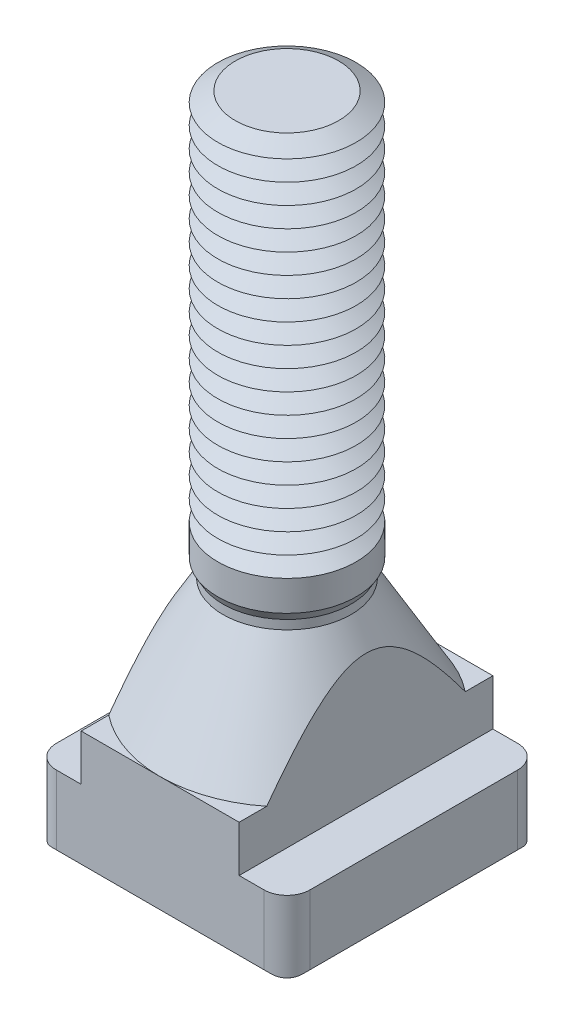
ISO-10303-21;
HEADER;
FILE_DESCRIPTION(('STEP AP214'),'2;1');
FILE_NAME('part.step','',(''),(''),'','','');
FILE_SCHEMA(('AUTOMOTIVE_DESIGN { 1 0 10303 214 1 1 1 1 }'));
ENDSEC;
DATA;
#1=APPLICATION_CONTEXT('core data for automotive mechanical design processes');
#2=APPLICATION_PROTOCOL_DEFINITION('international standard','automotive_design',2000,#1);
#3=PRODUCT_CONTEXT('',#1,'mechanical');
#4=PRODUCT('Part','Part','',(#3));
#5=PRODUCT_RELATED_PRODUCT_CATEGORY('part','',(#4));
#6=PRODUCT_DEFINITION_FORMATION('','',#4);
#7=PRODUCT_DEFINITION_CONTEXT('part definition',#1,'design');
#8=PRODUCT_DEFINITION('design','',#6,#7);
#9=PRODUCT_DEFINITION_SHAPE('','',#8);
#10=(LENGTH_UNIT() NAMED_UNIT(*) SI_UNIT(.MILLI.,.METRE.));
#11=(NAMED_UNIT(*) PLANE_ANGLE_UNIT() SI_UNIT($,.RADIAN.));
#12=(NAMED_UNIT(*) SI_UNIT($,.STERADIAN.) SOLID_ANGLE_UNIT());
#13=UNCERTAINTY_MEASURE_WITH_UNIT(LENGTH_MEASURE(1.E-05),#10,'distance_accuracy_value','');
#14=(GEOMETRIC_REPRESENTATION_CONTEXT(3) GLOBAL_UNCERTAINTY_ASSIGNED_CONTEXT((#13)) GLOBAL_UNIT_ASSIGNED_CONTEXT((#10,
#11,#12)) REPRESENTATION_CONTEXT('',''));
#15=CARTESIAN_POINT('',(0.,0.,0.));
#16=DIRECTION('',(0.,0.,1.));
#17=DIRECTION('',(1.,0.,0.));
#18=AXIS2_PLACEMENT_3D('',#15,#16,#17);
#19=CARTESIAN_POINT('',(0.,51.,0.));
#20=DIRECTION('',(0.,-1.,0.));
#21=DIRECTION('',(0.,0.,-1.));
#22=AXIS2_PLACEMENT_3D('',#19,#20,#21);
#23=CONICAL_SURFACE('',#22,4.48445554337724,1.0471975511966);
#24=CARTESIAN_POINT('',(0.,50.125,0.));
#25=DIRECTION('',(0.,-1.,0.));
#26=DIRECTION('',(0.,0.,-1.));
#27=AXIS2_PLACEMENT_3D('',#24,#25,#26);
#28=CIRCLE('',#27,6.00000000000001);
#29=CARTESIAN_POINT('',(0.,50.125,-6.00000000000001));
#30=VERTEX_POINT('',#29);
#31=EDGE_CURVE('E684',#30,#30,#28,.T.);
#32=ORIENTED_EDGE('',*,*,#31,.F.);
#33=EDGE_LOOP('',(#32));
#34=FACE_BOUND('',#33,.T.);
#35=CARTESIAN_POINT('',(0.,51.,0.));
#36=DIRECTION('',(0.,-1.,0.));
#37=DIRECTION('',(0.,0.,-1.));
#38=AXIS2_PLACEMENT_3D('',#35,#36,#37);
#39=CIRCLE('',#38,4.48445554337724);
#40=CARTESIAN_POINT('',(0.,51.,-4.48445554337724));
#41=VERTEX_POINT('',#40);
#42=EDGE_CURVE('E690',#41,#41,#39,.T.);
#43=ORIENTED_EDGE('',*,*,#42,.T.);
#44=EDGE_LOOP('',(#43));
#45=FACE_BOUND('',#44,.T.);
#46=ADVANCED_FACE('F39',(#34,#45),#23,.T.);
#47=CARTESIAN_POINT('',(0.,51.875,0.));
#48=DIRECTION('',(0.,1.,0.));
#49=DIRECTION('',(0.,0.,1.));
#50=AXIS2_PLACEMENT_3D('',#47,#48,#49);
#51=CONICAL_SURFACE('',#50,6.00000000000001,1.0471975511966);
#52=ORIENTED_EDGE('',*,*,#42,.F.);
#53=EDGE_LOOP('',(#52));
#54=FACE_BOUND('',#53,.T.);
#55=CARTESIAN_POINT('',(0.,51.875,0.));
#56=DIRECTION('',(0.,-1.,0.));
#57=DIRECTION('',(0.,0.,-1.));
#58=AXIS2_PLACEMENT_3D('',#55,#56,#57);
#59=CIRCLE('',#58,6.00000000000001);
#60=CARTESIAN_POINT('',(0.,51.875,-6.00000000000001));
#61=VERTEX_POINT('',#60);
#62=EDGE_CURVE('E701',#61,#61,#59,.T.);
#63=ORIENTED_EDGE('',*,*,#62,.T.);
#64=EDGE_LOOP('',(#63));
#65=FACE_BOUND('',#64,.T.);
#66=ADVANCED_FACE('F449',(#54,#65),#51,.T.);
#67=CARTESIAN_POINT('',(2.99828180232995,58.,0.));
#68=DIRECTION('',(0.,-1.,0.));
#69=DIRECTION('',(1.,0.,0.));
#70=AXIS2_PLACEMENT_3D('',#67,#68,#69);
#71=PLANE('',#70);
#72=CARTESIAN_POINT('',(0.,58.,0.));
#73=DIRECTION('',(0.,-1.,0.));
#74=DIRECTION('',(0.,0.,-1.));
#75=AXIS2_PLACEMENT_3D('',#72,#73,#74);
#76=CIRCLE('',#75,4.48445554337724);
#77=CARTESIAN_POINT('',(0.,58.,-4.48445554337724));
#78=VERTEX_POINT('',#77);
#79=EDGE_CURVE('E641',#78,#78,#76,.T.);
#80=ORIENTED_EDGE('',*,*,#79,.F.);
#81=EDGE_LOOP('',(#80));
#82=FACE_BOUND('',#81,.T.);
#83=ADVANCED_FACE('F455',(#82),#71,.F.);
#84=CARTESIAN_POINT('',(0.,58.,0.));
#85=DIRECTION('',(0.,-1.,0.));
#86=DIRECTION('',(0.,0.,-1.));
#87=AXIS2_PLACEMENT_3D('',#84,#85,#86);
#88=CONICAL_SURFACE('',#87,4.48445554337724,1.0471975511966);
#89=CARTESIAN_POINT('',(0.,57.125,0.));
#90=DIRECTION('',(0.,-1.,0.));
#91=DIRECTION('',(0.,0.,-1.));
#92=AXIS2_PLACEMENT_3D('',#89,#90,#91);
#93=CIRCLE('',#92,6.00000000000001);
#94=CARTESIAN_POINT('',(0.,57.125,-6.00000000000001));
#95=VERTEX_POINT('',#94);
#96=EDGE_CURVE('E639',#95,#95,#93,.T.);
#97=ORIENTED_EDGE('',*,*,#96,.F.);
#98=EDGE_LOOP('',(#97));
#99=FACE_BOUND('',#98,.T.);
#100=ORIENTED_EDGE('',*,*,#79,.T.);
#101=EDGE_LOOP('',(#100));
#102=FACE_BOUND('',#101,.T.);
#103=ADVANCED_FACE('F483',(#99,#102),#88,.T.);
#104=CARTESIAN_POINT('',(0.,57.125,0.));
#105=DIRECTION('',(0.,1.,0.));
#106=DIRECTION('',(0.,0.,1.));
#107=AXIS2_PLACEMENT_3D('',#104,#105,#106);
#108=CONICAL_SURFACE('',#107,6.00000000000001,1.0471975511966);
#109=CARTESIAN_POINT('',(0.,56.25,0.));
#110=DIRECTION('',(0.,-1.,0.));
#111=DIRECTION('',(0.,0.,-1.));
#112=AXIS2_PLACEMENT_3D('',#109,#110,#111);
#113=CIRCLE('',#112,4.48445554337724);
#114=CARTESIAN_POINT('',(0.,56.25,-4.48445554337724));
#115=VERTEX_POINT('',#114);
#116=EDGE_CURVE('E642',#115,#115,#113,.T.);
#117=ORIENTED_EDGE('',*,*,#116,.F.);
#118=EDGE_LOOP('',(#117));
#119=FACE_BOUND('',#118,.T.);
#120=ORIENTED_EDGE('',*,*,#96,.T.);
#121=EDGE_LOOP('',(#120));
#122=FACE_BOUND('',#121,.T.);
#123=ADVANCED_FACE('F480',(#119,#122),#108,.T.);
#124=CARTESIAN_POINT('',(0.,56.25,0.));
#125=DIRECTION('',(0.,-1.,0.));
#126=DIRECTION('',(0.,0.,-1.));
#127=AXIS2_PLACEMENT_3D('',#124,#125,#126);
#128=CONICAL_SURFACE('',#127,4.48445554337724,1.0471975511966);
#129=CARTESIAN_POINT('',(0.,55.375,0.));
#130=DIRECTION('',(0.,-1.,0.));
#131=DIRECTION('',(0.,0.,-1.));
#132=AXIS2_PLACEMENT_3D('',#129,#130,#131);
#133=CIRCLE('',#132,6.00000000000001);
#134=CARTESIAN_POINT('',(0.,55.375,-6.00000000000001));
#135=VERTEX_POINT('',#134);
#136=EDGE_CURVE('E650',#135,#135,#133,.T.);
#137=ORIENTED_EDGE('',*,*,#136,.F.);
#138=EDGE_LOOP('',(#137));
#139=FACE_BOUND('',#138,.T.);
#140=ORIENTED_EDGE('',*,*,#116,.T.);
#141=EDGE_LOOP('',(#140));
#142=FACE_BOUND('',#141,.T.);
#143=ADVANCED_FACE('F475',(#139,#142),#128,.T.);
#144=CARTESIAN_POINT('',(0.,55.375,0.));
#145=DIRECTION('',(0.,1.,0.));
#146=DIRECTION('',(0.,0.,1.));
#147=AXIS2_PLACEMENT_3D('',#144,#145,#146);
#148=CONICAL_SURFACE('',#147,6.00000000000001,1.0471975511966);
#149=CARTESIAN_POINT('',(0.,54.5,0.));
#150=DIRECTION('',(0.,-1.,0.));
#151=DIRECTION('',(0.,0.,-1.));
#152=AXIS2_PLACEMENT_3D('',#149,#150,#151);
#153=CIRCLE('',#152,4.48445554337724);
#154=CARTESIAN_POINT('',(0.,54.5,-4.48445554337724));
#155=VERTEX_POINT('',#154);
#156=EDGE_CURVE('E674',#155,#155,#153,.T.);
#157=ORIENTED_EDGE('',*,*,#156,.F.);
#158=EDGE_LOOP('',(#157));
#159=FACE_BOUND('',#158,.T.);
#160=ORIENTED_EDGE('',*,*,#136,.T.);
#161=EDGE_LOOP('',(#160));
#162=FACE_BOUND('',#161,.T.);
#163=ADVANCED_FACE('F472',(#159,#162),#148,.T.);
#164=CARTESIAN_POINT('',(0.,54.5,0.));
#165=DIRECTION('',(0.,-1.,0.));
#166=DIRECTION('',(0.,0.,-1.));
#167=AXIS2_PLACEMENT_3D('',#164,#165,#166);
#168=CONICAL_SURFACE('',#167,4.48445554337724,1.0471975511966);
#169=CARTESIAN_POINT('',(0.,53.625,0.));
#170=DIRECTION('',(0.,-1.,0.));
#171=DIRECTION('',(0.,0.,-1.));
#172=AXIS2_PLACEMENT_3D('',#169,#170,#171);
#173=CIRCLE('',#172,6.00000000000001);
#174=CARTESIAN_POINT('',(0.,53.625,-6.00000000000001));
#175=VERTEX_POINT('',#174);
#176=EDGE_CURVE('E709',#175,#175,#173,.T.);
#177=ORIENTED_EDGE('',*,*,#176,.F.);
#178=EDGE_LOOP('',(#177));
#179=FACE_BOUND('',#178,.T.);
#180=ORIENTED_EDGE('',*,*,#156,.T.);
#181=EDGE_LOOP('',(#180));
#182=FACE_BOUND('',#181,.T.);
#183=ADVANCED_FACE('F466',(#179,#182),#168,.T.);
#184=CARTESIAN_POINT('',(0.,53.625,0.));
#185=DIRECTION('',(0.,1.,0.));
#186=DIRECTION('',(0.,0.,1.));
#187=AXIS2_PLACEMENT_3D('',#184,#185,#186);
#188=CONICAL_SURFACE('',#187,6.00000000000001,1.0471975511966);
#189=CARTESIAN_POINT('',(0.,52.75,0.));
#190=DIRECTION('',(0.,-1.,0.));
#191=DIRECTION('',(0.,0.,-1.));
#192=AXIS2_PLACEMENT_3D('',#189,#190,#191);
#193=CIRCLE('',#192,4.48445554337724);
#194=CARTESIAN_POINT('',(0.,52.75,-4.48445554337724));
#195=VERTEX_POINT('',#194);
#196=EDGE_CURVE('E705',#195,#195,#193,.T.);
#197=ORIENTED_EDGE('',*,*,#196,.F.);
#198=EDGE_LOOP('',(#197));
#199=FACE_BOUND('',#198,.T.);
#200=ORIENTED_EDGE('',*,*,#176,.T.);
#201=EDGE_LOOP('',(#200));
#202=FACE_BOUND('',#201,.T.);
#203=ADVANCED_FACE('F462',(#199,#202),#188,.T.);
#204=CARTESIAN_POINT('',(0.,52.75,0.));
#205=DIRECTION('',(0.,-1.,0.));
#206=DIRECTION('',(0.,0.,-1.));
#207=AXIS2_PLACEMENT_3D('',#204,#205,#206);
#208=CONICAL_SURFACE('',#207,4.48445554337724,1.0471975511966);
#209=ORIENTED_EDGE('',*,*,#62,.F.);
#210=EDGE_LOOP('',(#209));
#211=FACE_BOUND('',#210,.T.);
#212=ORIENTED_EDGE('',*,*,#196,.T.);
#213=EDGE_LOOP('',(#212));
#214=FACE_BOUND('',#213,.T.);
#215=ADVANCED_FACE('F465',(#211,#214),#208,.T.);
#216=CARTESIAN_POINT('',(0.,49.25,0.));
#217=DIRECTION('',(0.,-1.,0.));
#218=DIRECTION('',(0.,0.,-1.));
#219=AXIS2_PLACEMENT_3D('',#216,#217,#218);
#220=CONICAL_SURFACE('',#219,4.48445554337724,1.0471975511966);
#221=CARTESIAN_POINT('',(0.,48.375,0.));
#222=DIRECTION('',(0.,-1.,0.));
#223=DIRECTION('',(0.,0.,-1.));
#224=AXIS2_PLACEMENT_3D('',#221,#222,#223);
#225=CIRCLE('',#224,6.00000000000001);
#226=CARTESIAN_POINT('',(0.,48.375,-6.00000000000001));
#227=VERTEX_POINT('',#226);
#228=EDGE_CURVE('E685',#227,#227,#225,.T.);
#229=ORIENTED_EDGE('',*,*,#228,.F.);
#230=EDGE_LOOP('',(#229));
#231=FACE_BOUND('',#230,.T.);
#232=CARTESIAN_POINT('',(0.,49.25,0.));
#233=DIRECTION('',(0.,-1.,0.));
#234=DIRECTION('',(0.,0.,-1.));
#235=AXIS2_PLACEMENT_3D('',#232,#233,#234);
#236=CIRCLE('',#235,4.48445554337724);
#237=CARTESIAN_POINT('',(0.,49.25,-4.48445554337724));
#238=VERTEX_POINT('',#237);
#239=EDGE_CURVE('E682',#238,#238,#236,.T.);
#240=ORIENTED_EDGE('',*,*,#239,.T.);
#241=EDGE_LOOP('',(#240));
#242=FACE_BOUND('',#241,.T.);
#243=ADVANCED_FACE('F470',(#231,#242),#220,.T.);
#244=CARTESIAN_POINT('',(0.,50.125,0.));
#245=DIRECTION('',(0.,1.,0.));
#246=DIRECTION('',(0.,0.,1.));
#247=AXIS2_PLACEMENT_3D('',#244,#245,#246);
#248=CONICAL_SURFACE('',#247,6.00000000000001,1.0471975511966);
#249=ORIENTED_EDGE('',*,*,#239,.F.);
#250=EDGE_LOOP('',(#249));
#251=FACE_BOUND('',#250,.T.);
#252=ORIENTED_EDGE('',*,*,#31,.T.);
#253=EDGE_LOOP('',(#252));
#254=FACE_BOUND('',#253,.T.);
#255=ADVANCED_FACE('F967',(#251,#254),#248,.T.);
#256=CARTESIAN_POINT('',(0.,47.5,0.));
#257=DIRECTION('',(0.,-1.,0.));
#258=DIRECTION('',(0.,0.,-1.));
#259=AXIS2_PLACEMENT_3D('',#256,#257,#258);
#260=CONICAL_SURFACE('',#259,4.48445554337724,1.0471975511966);
#261=CARTESIAN_POINT('',(0.,46.625,0.));
#262=DIRECTION('',(0.,-1.,0.));
#263=DIRECTION('',(0.,0.,-1.));
#264=AXIS2_PLACEMENT_3D('',#261,#262,#263);
#265=CIRCLE('',#264,6.00000000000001);
#266=CARTESIAN_POINT('',(0.,46.625,-6.00000000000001));
#267=VERTEX_POINT('',#266);
#268=EDGE_CURVE('E670',#267,#267,#265,.T.);
#269=ORIENTED_EDGE('',*,*,#268,.F.);
#270=EDGE_LOOP('',(#269));
#271=FACE_BOUND('',#270,.T.);
#272=CARTESIAN_POINT('',(0.,47.5,0.));
#273=DIRECTION('',(0.,-1.,0.));
#274=DIRECTION('',(0.,0.,-1.));
#275=AXIS2_PLACEMENT_3D('',#272,#273,#274);
#276=CIRCLE('',#275,4.48445554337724);
#277=CARTESIAN_POINT('',(0.,47.5,-4.48445554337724));
#278=VERTEX_POINT('',#277);
#279=EDGE_CURVE('E694',#278,#278,#276,.T.);
#280=ORIENTED_EDGE('',*,*,#279,.T.);
#281=EDGE_LOOP('',(#280));
#282=FACE_BOUND('',#281,.T.);
#283=ADVANCED_FACE('F963',(#271,#282),#260,.T.);
#284=CARTESIAN_POINT('',(0.,48.375,0.));
#285=DIRECTION('',(0.,1.,0.));
#286=DIRECTION('',(0.,0.,1.));
#287=AXIS2_PLACEMENT_3D('',#284,#285,#286);
#288=CONICAL_SURFACE('',#287,6.00000000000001,1.0471975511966);
#289=ORIENTED_EDGE('',*,*,#279,.F.);
#290=EDGE_LOOP('',(#289));
#291=FACE_BOUND('',#290,.T.);
#292=ORIENTED_EDGE('',*,*,#228,.T.);
#293=EDGE_LOOP('',(#292));
#294=FACE_BOUND('',#293,.T.);
#295=ADVANCED_FACE('F952',(#291,#294),#288,.T.);
#296=CARTESIAN_POINT('',(0.,45.75,0.));
#297=DIRECTION('',(0.,-1.,0.));
#298=DIRECTION('',(0.,0.,-1.));
#299=AXIS2_PLACEMENT_3D('',#296,#297,#298);
#300=CONICAL_SURFACE('',#299,4.48445554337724,1.0471975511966);
#301=CARTESIAN_POINT('',(0.,44.875,0.));
#302=DIRECTION('',(0.,-1.,0.));
#303=DIRECTION('',(0.,0.,-1.));
#304=AXIS2_PLACEMENT_3D('',#301,#302,#303);
#305=CIRCLE('',#304,6.00000000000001);
#306=CARTESIAN_POINT('',(0.,44.875,-6.00000000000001));
#307=VERTEX_POINT('',#306);
#308=EDGE_CURVE('E671',#307,#307,#305,.T.);
#309=ORIENTED_EDGE('',*,*,#308,.F.);
#310=EDGE_LOOP('',(#309));
#311=FACE_BOUND('',#310,.T.);
#312=CARTESIAN_POINT('',(0.,45.75,0.));
#313=DIRECTION('',(0.,-1.,0.));
#314=DIRECTION('',(0.,0.,-1.));
#315=AXIS2_PLACEMENT_3D('',#312,#313,#314);
#316=CIRCLE('',#315,4.48445554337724);
#317=CARTESIAN_POINT('',(0.,45.75,-4.48445554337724));
#318=VERTEX_POINT('',#317);
#319=EDGE_CURVE('E667',#318,#318,#316,.T.);
#320=ORIENTED_EDGE('',*,*,#319,.T.);
#321=EDGE_LOOP('',(#320));
#322=FACE_BOUND('',#321,.T.);
#323=ADVANCED_FACE('F949',(#311,#322),#300,.T.);
#324=CARTESIAN_POINT('',(0.,46.625,0.));
#325=DIRECTION('',(0.,1.,0.));
#326=DIRECTION('',(0.,0.,1.));
#327=AXIS2_PLACEMENT_3D('',#324,#325,#326);
#328=CONICAL_SURFACE('',#327,6.00000000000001,1.0471975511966);
#329=ORIENTED_EDGE('',*,*,#319,.F.);
#330=EDGE_LOOP('',(#329));
#331=FACE_BOUND('',#330,.T.);
#332=ORIENTED_EDGE('',*,*,#268,.T.);
#333=EDGE_LOOP('',(#332));
#334=FACE_BOUND('',#333,.T.);
#335=ADVANCED_FACE('F940',(#331,#334),#328,.T.);
#336=CARTESIAN_POINT('',(0.,44.,0.));
#337=DIRECTION('',(0.,-1.,0.));
#338=DIRECTION('',(0.,0.,-1.));
#339=AXIS2_PLACEMENT_3D('',#336,#337,#338);
#340=CONICAL_SURFACE('',#339,4.48445554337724,1.0471975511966);
#341=CARTESIAN_POINT('',(0.,43.125,0.));
#342=DIRECTION('',(0.,-1.,0.));
#343=DIRECTION('',(0.,0.,-1.));
#344=AXIS2_PLACEMENT_3D('',#341,#342,#343);
#345=CIRCLE('',#344,6.00000000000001);
#346=CARTESIAN_POINT('',(0.,43.125,-6.00000000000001));
#347=VERTEX_POINT('',#346);
#348=EDGE_CURVE('E768',#347,#347,#345,.T.);
#349=ORIENTED_EDGE('',*,*,#348,.F.);
#350=EDGE_LOOP('',(#349));
#351=FACE_BOUND('',#350,.T.);
#352=CARTESIAN_POINT('',(0.,44.,0.));
#353=DIRECTION('',(0.,-1.,0.));
#354=DIRECTION('',(0.,0.,-1.));
#355=AXIS2_PLACEMENT_3D('',#352,#353,#354);
#356=CIRCLE('',#355,4.48445554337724);
#357=CARTESIAN_POINT('',(0.,44.,-4.48445554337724));
#358=VERTEX_POINT('',#357);
#359=EDGE_CURVE('E766',#358,#358,#356,.T.);
#360=ORIENTED_EDGE('',*,*,#359,.T.);
#361=EDGE_LOOP('',(#360));
#362=FACE_BOUND('',#361,.T.);
#363=ADVANCED_FACE('F937',(#351,#362),#340,.T.);
#364=CARTESIAN_POINT('',(0.,44.875,0.));
#365=DIRECTION('',(0.,1.,0.));
#366=DIRECTION('',(0.,0.,1.));
#367=AXIS2_PLACEMENT_3D('',#364,#365,#366);
#368=CONICAL_SURFACE('',#367,6.00000000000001,1.0471975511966);
#369=ORIENTED_EDGE('',*,*,#359,.F.);
#370=EDGE_LOOP('',(#369));
#371=FACE_BOUND('',#370,.T.);
#372=ORIENTED_EDGE('',*,*,#308,.T.);
#373=EDGE_LOOP('',(#372));
#374=FACE_BOUND('',#373,.T.);
#375=ADVANCED_FACE('F928',(#371,#374),#368,.T.);
#376=CARTESIAN_POINT('',(0.,42.25,0.));
#377=DIRECTION('',(0.,-1.,0.));
#378=DIRECTION('',(0.,0.,-1.));
#379=AXIS2_PLACEMENT_3D('',#376,#377,#378);
#380=CONICAL_SURFACE('',#379,4.48445554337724,1.0471975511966);
#381=CARTESIAN_POINT('',(0.,41.375,0.));
#382=DIRECTION('',(0.,-1.,0.));
#383=DIRECTION('',(0.,0.,-1.));
#384=AXIS2_PLACEMENT_3D('',#381,#382,#383);
#385=CIRCLE('',#384,6.00000000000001);
#386=CARTESIAN_POINT('',(0.,41.375,-6.00000000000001));
#387=VERTEX_POINT('',#386);
#388=EDGE_CURVE('E661',#387,#387,#385,.T.);
#389=ORIENTED_EDGE('',*,*,#388,.F.);
#390=EDGE_LOOP('',(#389));
#391=FACE_BOUND('',#390,.T.);
#392=CARTESIAN_POINT('',(0.,42.25,0.));
#393=DIRECTION('',(0.,-1.,0.));
#394=DIRECTION('',(0.,0.,-1.));
#395=AXIS2_PLACEMENT_3D('',#392,#393,#394);
#396=CIRCLE('',#395,4.48445554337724);
#397=CARTESIAN_POINT('',(0.,42.25,-4.48445554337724));
#398=VERTEX_POINT('',#397);
#399=EDGE_CURVE('E664',#398,#398,#396,.T.);
#400=ORIENTED_EDGE('',*,*,#399,.T.);
#401=EDGE_LOOP('',(#400));
#402=FACE_BOUND('',#401,.T.);
#403=ADVANCED_FACE('F925',(#391,#402),#380,.T.);
#404=CARTESIAN_POINT('',(0.,43.125,0.));
#405=DIRECTION('',(0.,1.,0.));
#406=DIRECTION('',(0.,0.,1.));
#407=AXIS2_PLACEMENT_3D('',#404,#405,#406);
#408=CONICAL_SURFACE('',#407,6.00000000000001,1.0471975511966);
#409=ORIENTED_EDGE('',*,*,#399,.F.);
#410=EDGE_LOOP('',(#409));
#411=FACE_BOUND('',#410,.T.);
#412=ORIENTED_EDGE('',*,*,#348,.T.);
#413=EDGE_LOOP('',(#412));
#414=FACE_BOUND('',#413,.T.);
#415=ADVANCED_FACE('F916',(#411,#414),#408,.T.);
#416=CARTESIAN_POINT('',(0.,40.5,0.));
#417=DIRECTION('',(0.,-1.,0.));
#418=DIRECTION('',(0.,0.,-1.));
#419=AXIS2_PLACEMENT_3D('',#416,#417,#418);
#420=CONICAL_SURFACE('',#419,4.48445554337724,1.0471975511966);
#421=CARTESIAN_POINT('',(0.,39.625,0.));
#422=DIRECTION('',(0.,-1.,0.));
#423=DIRECTION('',(0.,0.,-1.));
#424=AXIS2_PLACEMENT_3D('',#421,#422,#423);
#425=CIRCLE('',#424,6.00000000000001);
#426=CARTESIAN_POINT('',(0.,39.625,-6.00000000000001));
#427=VERTEX_POINT('',#426);
#428=EDGE_CURVE('E761',#427,#427,#425,.T.);
#429=ORIENTED_EDGE('',*,*,#428,.F.);
#430=EDGE_LOOP('',(#429));
#431=FACE_BOUND('',#430,.T.);
#432=CARTESIAN_POINT('',(0.,40.5,0.));
#433=DIRECTION('',(0.,-1.,0.));
#434=DIRECTION('',(0.,0.,-1.));
#435=AXIS2_PLACEMENT_3D('',#432,#433,#434);
#436=CIRCLE('',#435,4.48445554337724);
#437=CARTESIAN_POINT('',(0.,40.5,-4.48445554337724));
#438=VERTEX_POINT('',#437);
#439=EDGE_CURVE('E665',#438,#438,#436,.T.);
#440=ORIENTED_EDGE('',*,*,#439,.T.);
#441=EDGE_LOOP('',(#440));
#442=FACE_BOUND('',#441,.T.);
#443=ADVANCED_FACE('F913',(#431,#442),#420,.T.);
#444=CARTESIAN_POINT('',(0.,41.375,0.));
#445=DIRECTION('',(0.,1.,0.));
#446=DIRECTION('',(0.,0.,1.));
#447=AXIS2_PLACEMENT_3D('',#444,#445,#446);
#448=CONICAL_SURFACE('',#447,6.00000000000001,1.0471975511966);
#449=ORIENTED_EDGE('',*,*,#439,.F.);
#450=EDGE_LOOP('',(#449));
#451=FACE_BOUND('',#450,.T.);
#452=ORIENTED_EDGE('',*,*,#388,.T.);
#453=EDGE_LOOP('',(#452));
#454=FACE_BOUND('',#453,.T.);
#455=ADVANCED_FACE('F904',(#451,#454),#448,.T.);
#456=CARTESIAN_POINT('',(0.,38.75,0.));
#457=DIRECTION('',(0.,-1.,0.));
#458=DIRECTION('',(0.,0.,-1.));
#459=AXIS2_PLACEMENT_3D('',#456,#457,#458);
#460=CONICAL_SURFACE('',#459,4.48445554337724,1.0471975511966);
#461=CARTESIAN_POINT('',(0.,37.875,0.));
#462=DIRECTION('',(0.,-1.,0.));
#463=DIRECTION('',(0.,0.,-1.));
#464=AXIS2_PLACEMENT_3D('',#461,#462,#463);
#465=CIRCLE('',#464,6.00000000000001);
#466=CARTESIAN_POINT('',(0.,37.875,-6.00000000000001));
#467=VERTEX_POINT('',#466);
#468=EDGE_CURVE('E679',#467,#467,#465,.T.);
#469=ORIENTED_EDGE('',*,*,#468,.F.);
#470=EDGE_LOOP('',(#469));
#471=FACE_BOUND('',#470,.T.);
#472=CARTESIAN_POINT('',(0.,38.75,0.));
#473=DIRECTION('',(0.,-1.,0.));
#474=DIRECTION('',(0.,0.,-1.));
#475=AXIS2_PLACEMENT_3D('',#472,#473,#474);
#476=CIRCLE('',#475,4.48445554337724);
#477=CARTESIAN_POINT('',(0.,38.75,-4.48445554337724));
#478=VERTEX_POINT('',#477);
#479=EDGE_CURVE('E764',#478,#478,#476,.T.);
#480=ORIENTED_EDGE('',*,*,#479,.T.);
#481=EDGE_LOOP('',(#480));
#482=FACE_BOUND('',#481,.T.);
#483=ADVANCED_FACE('F901',(#471,#482),#460,.T.);
#484=CARTESIAN_POINT('',(0.,39.625,0.));
#485=DIRECTION('',(0.,1.,0.));
#486=DIRECTION('',(0.,0.,1.));
#487=AXIS2_PLACEMENT_3D('',#484,#485,#486);
#488=CONICAL_SURFACE('',#487,6.00000000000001,1.0471975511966);
#489=ORIENTED_EDGE('',*,*,#479,.F.);
#490=EDGE_LOOP('',(#489));
#491=FACE_BOUND('',#490,.T.);
#492=ORIENTED_EDGE('',*,*,#428,.T.);
#493=EDGE_LOOP('',(#492));
#494=FACE_BOUND('',#493,.T.);
#495=ADVANCED_FACE('F892',(#491,#494),#488,.T.);
#496=CARTESIAN_POINT('',(0.,37.,0.));
#497=DIRECTION('',(0.,-1.,0.));
#498=DIRECTION('',(0.,0.,-1.));
#499=AXIS2_PLACEMENT_3D('',#496,#497,#498);
#500=CONICAL_SURFACE('',#499,4.48445554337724,1.0471975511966);
#501=CARTESIAN_POINT('',(0.,36.125,0.));
#502=DIRECTION('',(0.,-1.,0.));
#503=DIRECTION('',(0.,0.,-1.));
#504=AXIS2_PLACEMENT_3D('',#501,#502,#503);
#505=CIRCLE('',#504,6.00000000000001);
#506=CARTESIAN_POINT('',(0.,36.125,-6.00000000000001));
#507=VERTEX_POINT('',#506);
#508=EDGE_CURVE('E680',#507,#507,#505,.T.);
#509=ORIENTED_EDGE('',*,*,#508,.F.);
#510=EDGE_LOOP('',(#509));
#511=FACE_BOUND('',#510,.T.);
#512=CARTESIAN_POINT('',(0.,37.,0.));
#513=DIRECTION('',(0.,-1.,0.));
#514=DIRECTION('',(0.,0.,-1.));
#515=AXIS2_PLACEMENT_3D('',#512,#513,#514);
#516=CIRCLE('',#515,4.48445554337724);
#517=CARTESIAN_POINT('',(0.,37.,-4.48445554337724));
#518=VERTEX_POINT('',#517);
#519=EDGE_CURVE('E676',#518,#518,#516,.T.);
#520=ORIENTED_EDGE('',*,*,#519,.T.);
#521=EDGE_LOOP('',(#520));
#522=FACE_BOUND('',#521,.T.);
#523=ADVANCED_FACE('F889',(#511,#522),#500,.T.);
#524=CARTESIAN_POINT('',(0.,37.875,0.));
#525=DIRECTION('',(0.,1.,0.));
#526=DIRECTION('',(0.,0.,1.));
#527=AXIS2_PLACEMENT_3D('',#524,#525,#526);
#528=CONICAL_SURFACE('',#527,6.00000000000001,1.0471975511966);
#529=ORIENTED_EDGE('',*,*,#519,.F.);
#530=EDGE_LOOP('',(#529));
#531=FACE_BOUND('',#530,.T.);
#532=ORIENTED_EDGE('',*,*,#468,.T.);
#533=EDGE_LOOP('',(#532));
#534=FACE_BOUND('',#533,.T.);
#535=ADVANCED_FACE('F880',(#531,#534),#528,.T.);
#536=CARTESIAN_POINT('',(0.,35.25,0.));
#537=DIRECTION('',(0.,-1.,0.));
#538=DIRECTION('',(0.,0.,-1.));
#539=AXIS2_PLACEMENT_3D('',#536,#537,#538);
#540=CONICAL_SURFACE('',#539,4.48445554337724,1.0471975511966);
#541=CARTESIAN_POINT('',(0.,34.375,0.));
#542=DIRECTION('',(0.,-1.,0.));
#543=DIRECTION('',(0.,0.,-1.));
#544=AXIS2_PLACEMENT_3D('',#541,#542,#543);
#545=CIRCLE('',#544,6.00000000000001);
#546=CARTESIAN_POINT('',(0.,34.375,-6.00000000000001));
#547=VERTEX_POINT('',#546);
#548=EDGE_CURVE('E726',#547,#547,#545,.T.);
#549=ORIENTED_EDGE('',*,*,#548,.F.);
#550=EDGE_LOOP('',(#549));
#551=FACE_BOUND('',#550,.T.);
#552=CARTESIAN_POINT('',(0.,35.25,0.));
#553=DIRECTION('',(0.,-1.,0.));
#554=DIRECTION('',(0.,0.,-1.));
#555=AXIS2_PLACEMENT_3D('',#552,#553,#554);
#556=CIRCLE('',#555,4.48445554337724);
#557=CARTESIAN_POINT('',(0.,35.25,-4.48445554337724));
#558=VERTEX_POINT('',#557);
#559=EDGE_CURVE('E723',#558,#558,#556,.T.);
#560=ORIENTED_EDGE('',*,*,#559,.T.);
#561=EDGE_LOOP('',(#560));
#562=FACE_BOUND('',#561,.T.);
#563=ADVANCED_FACE('F877',(#551,#562),#540,.T.);
#564=CARTESIAN_POINT('',(0.,36.125,0.));
#565=DIRECTION('',(0.,1.,0.));
#566=DIRECTION('',(0.,0.,1.));
#567=AXIS2_PLACEMENT_3D('',#564,#565,#566);
#568=CONICAL_SURFACE('',#567,6.00000000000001,1.0471975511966);
#569=ORIENTED_EDGE('',*,*,#559,.F.);
#570=EDGE_LOOP('',(#569));
#571=FACE_BOUND('',#570,.T.);
#572=ORIENTED_EDGE('',*,*,#508,.T.);
#573=EDGE_LOOP('',(#572));
#574=FACE_BOUND('',#573,.T.);
#575=ADVANCED_FACE('F868',(#571,#574),#568,.T.);
#576=CARTESIAN_POINT('',(0.,33.5,0.));
#577=DIRECTION('',(0.,-1.,0.));
#578=DIRECTION('',(0.,0.,-1.));
#579=AXIS2_PLACEMENT_3D('',#576,#577,#578);
#580=CONICAL_SURFACE('',#579,4.48445554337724,1.0471975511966);
#581=CARTESIAN_POINT('',(0.,32.625,0.));
#582=DIRECTION('',(0.,-1.,0.));
#583=DIRECTION('',(0.,0.,-1.));
#584=AXIS2_PLACEMENT_3D('',#581,#582,#583);
#585=CIRCLE('',#584,6.00000000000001);
#586=CARTESIAN_POINT('',(0.,32.625,-6.00000000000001));
#587=VERTEX_POINT('',#586);
#588=EDGE_CURVE('E804',#587,#587,#585,.T.);
#589=ORIENTED_EDGE('',*,*,#588,.F.);
#590=EDGE_LOOP('',(#589));
#591=FACE_BOUND('',#590,.T.);
#592=CARTESIAN_POINT('',(0.,33.5,0.));
#593=DIRECTION('',(0.,-1.,0.));
#594=DIRECTION('',(0.,0.,-1.));
#595=AXIS2_PLACEMENT_3D('',#592,#593,#594);
#596=CIRCLE('',#595,4.48445554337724);
#597=CARTESIAN_POINT('',(0.,33.5,-4.48445554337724));
#598=VERTEX_POINT('',#597);
#599=EDGE_CURVE('E778',#598,#598,#596,.T.);
#600=ORIENTED_EDGE('',*,*,#599,.T.);
#601=EDGE_LOOP('',(#600));
#602=FACE_BOUND('',#601,.T.);
#603=ADVANCED_FACE('F865',(#591,#602),#580,.T.);
#604=CARTESIAN_POINT('',(0.,34.375,0.));
#605=DIRECTION('',(0.,1.,0.));
#606=DIRECTION('',(0.,0.,1.));
#607=AXIS2_PLACEMENT_3D('',#604,#605,#606);
#608=CONICAL_SURFACE('',#607,6.00000000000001,1.0471975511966);
#609=ORIENTED_EDGE('',*,*,#599,.F.);
#610=EDGE_LOOP('',(#609));
#611=FACE_BOUND('',#610,.T.);
#612=ORIENTED_EDGE('',*,*,#548,.T.);
#613=EDGE_LOOP('',(#612));
#614=FACE_BOUND('',#613,.T.);
#615=ADVANCED_FACE('F856',(#611,#614),#608,.T.);
#616=CARTESIAN_POINT('',(0.,31.75,0.));
#617=DIRECTION('',(0.,-1.,0.));
#618=DIRECTION('',(0.,0.,-1.));
#619=AXIS2_PLACEMENT_3D('',#616,#617,#618);
#620=CONICAL_SURFACE('',#619,4.48445554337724,1.0471975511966);
#621=CARTESIAN_POINT('',(0.,30.875,0.));
#622=DIRECTION('',(0.,-1.,0.));
#623=DIRECTION('',(0.,0.,-1.));
#624=AXIS2_PLACEMENT_3D('',#621,#622,#623);
#625=CIRCLE('',#624,6.00000000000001);
#626=CARTESIAN_POINT('',(0.,30.875,-6.00000000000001));
#627=VERTEX_POINT('',#626);
#628=EDGE_CURVE('E771',#627,#627,#625,.T.);
#629=ORIENTED_EDGE('',*,*,#628,.F.);
#630=EDGE_LOOP('',(#629));
#631=FACE_BOUND('',#630,.T.);
#632=CARTESIAN_POINT('',(0.,31.75,0.));
#633=DIRECTION('',(0.,-1.,0.));
#634=DIRECTION('',(0.,0.,-1.));
#635=AXIS2_PLACEMENT_3D('',#632,#633,#634);
#636=CIRCLE('',#635,4.48445554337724);
#637=CARTESIAN_POINT('',(0.,31.75,-4.48445554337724));
#638=VERTEX_POINT('',#637);
#639=EDGE_CURVE('E774',#638,#638,#636,.T.);
#640=ORIENTED_EDGE('',*,*,#639,.T.);
#641=EDGE_LOOP('',(#640));
#642=FACE_BOUND('',#641,.T.);
#643=ADVANCED_FACE('F853',(#631,#642),#620,.T.);
#644=CARTESIAN_POINT('',(0.,32.625,0.));
#645=DIRECTION('',(0.,1.,0.));
#646=DIRECTION('',(0.,0.,1.));
#647=AXIS2_PLACEMENT_3D('',#644,#645,#646);
#648=CONICAL_SURFACE('',#647,6.00000000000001,1.0471975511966);
#649=ORIENTED_EDGE('',*,*,#639,.F.);
#650=EDGE_LOOP('',(#649));
#651=FACE_BOUND('',#650,.T.);
#652=ORIENTED_EDGE('',*,*,#588,.T.);
#653=EDGE_LOOP('',(#652));
#654=FACE_BOUND('',#653,.T.);
#655=ADVANCED_FACE('F844',(#651,#654),#648,.T.);
#656=CARTESIAN_POINT('',(0.,30.,0.));
#657=DIRECTION('',(0.,-1.,0.));
#658=DIRECTION('',(0.,0.,-1.));
#659=AXIS2_PLACEMENT_3D('',#656,#657,#658);
#660=CONICAL_SURFACE('',#659,4.48445554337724,1.0471975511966);
#661=CARTESIAN_POINT('',(0.,29.125,0.));
#662=DIRECTION('',(0.,-1.,0.));
#663=DIRECTION('',(0.,0.,-1.));
#664=AXIS2_PLACEMENT_3D('',#661,#662,#663);
#665=CIRCLE('',#664,6.00000000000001);
#666=CARTESIAN_POINT('',(0.,29.125,-6.00000000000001));
#667=VERTEX_POINT('',#666);
#668=EDGE_CURVE('E728',#667,#667,#665,.T.);
#669=ORIENTED_EDGE('',*,*,#668,.F.);
#670=EDGE_LOOP('',(#669));
#671=FACE_BOUND('',#670,.T.);
#672=CARTESIAN_POINT('',(0.,30.,0.));
#673=DIRECTION('',(0.,-1.,0.));
#674=DIRECTION('',(0.,0.,-1.));
#675=AXIS2_PLACEMENT_3D('',#672,#673,#674);
#676=CIRCLE('',#675,4.48445554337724);
#677=CARTESIAN_POINT('',(0.,30.,-4.48445554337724));
#678=VERTEX_POINT('',#677);
#679=EDGE_CURVE('E730',#678,#678,#676,.T.);
#680=ORIENTED_EDGE('',*,*,#679,.T.);
#681=EDGE_LOOP('',(#680));
#682=FACE_BOUND('',#681,.T.);
#683=ADVANCED_FACE('F841',(#671,#682),#660,.T.);
#684=CARTESIAN_POINT('',(0.,30.875,0.));
#685=DIRECTION('',(0.,1.,0.));
#686=DIRECTION('',(0.,0.,1.));
#687=AXIS2_PLACEMENT_3D('',#684,#685,#686);
#688=CONICAL_SURFACE('',#687,6.00000000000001,1.0471975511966);
#689=ORIENTED_EDGE('',*,*,#679,.F.);
#690=EDGE_LOOP('',(#689));
#691=FACE_BOUND('',#690,.T.);
#692=ORIENTED_EDGE('',*,*,#628,.T.);
#693=EDGE_LOOP('',(#692));
#694=FACE_BOUND('',#693,.T.);
#695=ADVANCED_FACE('F832',(#691,#694),#688,.T.);
#696=CARTESIAN_POINT('',(0.,28.25,0.));
#697=DIRECTION('',(0.,-1.,0.));
#698=DIRECTION('',(0.,0.,-1.));
#699=AXIS2_PLACEMENT_3D('',#696,#697,#698);
#700=CONICAL_SURFACE('',#699,4.48445554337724,1.0471975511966);
#701=CARTESIAN_POINT('',(0.,27.375,0.));
#702=DIRECTION('',(0.,-1.,0.));
#703=DIRECTION('',(0.,0.,-1.));
#704=AXIS2_PLACEMENT_3D('',#701,#702,#703);
#705=CIRCLE('',#704,6.00000000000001);
#706=CARTESIAN_POINT('',(0.,27.375,-6.00000000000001));
#707=VERTEX_POINT('',#706);
#708=EDGE_CURVE('E736',#707,#707,#705,.T.);
#709=ORIENTED_EDGE('',*,*,#708,.F.);
#710=EDGE_LOOP('',(#709));
#711=FACE_BOUND('',#710,.T.);
#712=CARTESIAN_POINT('',(0.,28.25,0.));
#713=DIRECTION('',(0.,-1.,0.));
#714=DIRECTION('',(0.,0.,-1.));
#715=AXIS2_PLACEMENT_3D('',#712,#713,#714);
#716=CIRCLE('',#715,4.48445554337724);
#717=CARTESIAN_POINT('',(0.,28.25,-4.48445554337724));
#718=VERTEX_POINT('',#717);
#719=EDGE_CURVE('E731',#718,#718,#716,.T.);
#720=ORIENTED_EDGE('',*,*,#719,.T.);
#721=EDGE_LOOP('',(#720));
#722=FACE_BOUND('',#721,.T.);
#723=ADVANCED_FACE('F828',(#711,#722),#700,.T.);
#724=CARTESIAN_POINT('',(0.,29.125,0.));
#725=DIRECTION('',(0.,1.,0.));
#726=DIRECTION('',(0.,0.,1.));
#727=AXIS2_PLACEMENT_3D('',#724,#725,#726);
#728=CONICAL_SURFACE('',#727,6.00000000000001,1.0471975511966);
#729=ORIENTED_EDGE('',*,*,#719,.F.);
#730=EDGE_LOOP('',(#729));
#731=FACE_BOUND('',#730,.T.);
#732=ORIENTED_EDGE('',*,*,#668,.T.);
#733=EDGE_LOOP('',(#732));
#734=FACE_BOUND('',#733,.T.);
#735=ADVANCED_FACE('F831',(#731,#734),#728,.T.);
#736=CARTESIAN_POINT('',(0.,26.5,0.));
#737=DIRECTION('',(0.,-1.,0.));
#738=DIRECTION('',(0.,0.,-1.));
#739=AXIS2_PLACEMENT_3D('',#736,#737,#738);
#740=CONICAL_SURFACE('',#739,4.48445554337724,1.0471975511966);
#741=CARTESIAN_POINT('',(0.,25.625,0.));
#742=DIRECTION('',(0.,-1.,0.));
#743=DIRECTION('',(0.,0.,-1.));
#744=AXIS2_PLACEMENT_3D('',#741,#742,#743);
#745=CIRCLE('',#744,6.00000000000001);
#746=CARTESIAN_POINT('',(0.,25.625,-6.00000000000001));
#747=VERTEX_POINT('',#746);
#748=EDGE_CURVE('E734',#747,#747,#745,.T.);
#749=ORIENTED_EDGE('',*,*,#748,.F.);
#750=EDGE_LOOP('',(#749));
#751=FACE_BOUND('',#750,.T.);
#752=CARTESIAN_POINT('',(0.,26.5,0.));
#753=DIRECTION('',(0.,-1.,0.));
#754=DIRECTION('',(0.,0.,-1.));
#755=AXIS2_PLACEMENT_3D('',#752,#753,#754);
#756=CIRCLE('',#755,4.48445554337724);
#757=CARTESIAN_POINT('',(0.,26.5,-4.48445554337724));
#758=VERTEX_POINT('',#757);
#759=EDGE_CURVE('E820',#758,#758,#756,.T.);
#760=ORIENTED_EDGE('',*,*,#759,.T.);
#761=EDGE_LOOP('',(#760));
#762=FACE_BOUND('',#761,.T.);
#763=ADVANCED_FACE('F567',(#751,#762),#740,.T.);
#764=CARTESIAN_POINT('',(0.,27.375,0.));
#765=DIRECTION('',(0.,1.,0.));
#766=DIRECTION('',(0.,0.,1.));
#767=AXIS2_PLACEMENT_3D('',#764,#765,#766);
#768=CONICAL_SURFACE('',#767,6.00000000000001,1.0471975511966);
#769=ORIENTED_EDGE('',*,*,#759,.F.);
#770=EDGE_LOOP('',(#769));
#771=FACE_BOUND('',#770,.T.);
#772=ORIENTED_EDGE('',*,*,#708,.T.);
#773=EDGE_LOOP('',(#772));
#774=FACE_BOUND('',#773,.T.);
#775=ADVANCED_FACE('F562',(#771,#774),#768,.T.);
#776=CARTESIAN_POINT('',(-10.0571909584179,3.88561808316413,-10.0571909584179));
#777=DIRECTION('',(-0.577350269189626,0.577350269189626,-0.577350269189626));
#778=DIRECTION('',(-0.707106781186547,0.,0.707106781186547));
#779=AXIS2_PLACEMENT_3D('',#776,#777,#778);
#780=CYLINDRICAL_SURFACE('',#779,2.);
#781=CARTESIAN_POINT('',(-6.17157287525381,0.,-6.17157287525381));
#782=DIRECTION('',(0.,1.,0.));
#783=DIRECTION('',(-0.707106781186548,0.,-0.707106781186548));
#784=AXIS2_PLACEMENT_3D('',#781,#782,#783);
#785=ELLIPSE('',#784,3.46410161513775,2.);
#786=CARTESIAN_POINT('',(-9.,0.,-7.5857864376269));
#787=VERTEX_POINT('',#786);
#788=CARTESIAN_POINT('',(-7.5857864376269,0.,-9.));
#789=VERTEX_POINT('',#788);
#790=EDGE_CURVE('E326',#787,#789,#785,.F.);
#791=ORIENTED_EDGE('',*,*,#790,.F.);
#792=DIRECTION('',(0.577350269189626,-0.577350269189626,0.577350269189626));
#793=VECTOR('',#792,1.);
#794=CARTESIAN_POINT('',(-4.1380711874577,-4.8619288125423,-2.72385762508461));
#795=LINE('',#794,#793);
#796=CARTESIAN_POINT('',(-10.9318516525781,1.93185165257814,-9.51763809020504));
#797=VERTEX_POINT('',#796);
#798=EDGE_CURVE('E367',#797,#787,#795,.T.);
#799=ORIENTED_EDGE('',*,*,#798,.F.);
#800=CARTESIAN_POINT('',(-9.,2.82842712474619,-9.));
#801=DIRECTION('',(0.325057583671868,-0.888073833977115,0.325057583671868));
#802=DIRECTION('',(-0.627963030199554,-0.459700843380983,-0.627963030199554));
#803=AXIS2_PLACEMENT_3D('',#800,#801,#802);
#804=ELLIPSE('',#803,2.25206500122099,2.);
#805=CARTESIAN_POINT('',(-9.51763809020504,1.93185165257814,-10.9318516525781));
#806=VERTEX_POINT('',#805);
#807=EDGE_CURVE('E264',#797,#806,#804,.T.);
#808=ORIENTED_EDGE('',*,*,#807,.T.);
#809=DIRECTION('',(0.577350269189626,-0.577350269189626,0.577350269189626));
#810=VECTOR('',#809,1.);
#811=CARTESIAN_POINT('',(-10.0571909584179,2.47140452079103,-11.471404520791));
#812=LINE('',#811,#810);
#813=EDGE_CURVE('E360',#789,#806,#812,.F.);
#814=ORIENTED_EDGE('',*,*,#813,.F.);
#815=EDGE_LOOP('',(#791,#799,#808,#814));
#816=FACE_BOUND('',#815,.T.);
#817=ADVANCED_FACE('F551',(#816),#780,.T.);
#818=CARTESIAN_POINT('',(2.7238576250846,-3.4477152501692,-2.7238576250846));
#819=DIRECTION('',(0.577350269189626,0.577350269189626,-0.577350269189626));
#820=DIRECTION('',(-0.707106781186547,0.,-0.707106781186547));
#821=AXIS2_PLACEMENT_3D('',#818,#819,#820);
#822=CYLINDRICAL_SURFACE('',#821,2.);
#823=CARTESIAN_POINT('',(6.17157287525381,0.,-6.17157287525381));
#824=DIRECTION('',(0.,1.,0.));
#825=DIRECTION('',(0.707106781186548,0.,-0.707106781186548));
#826=AXIS2_PLACEMENT_3D('',#823,#824,#825);
#827=ELLIPSE('',#826,3.46410161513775,2.);
#828=CARTESIAN_POINT('',(7.5857864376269,0.,-9.));
#829=VERTEX_POINT('',#828);
#830=CARTESIAN_POINT('',(9.,0.,-7.5857864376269));
#831=VERTEX_POINT('',#830);
#832=EDGE_CURVE('E332',#829,#831,#827,.F.);
#833=ORIENTED_EDGE('',*,*,#832,.F.);
#834=DIRECTION('',(-0.577350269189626,-0.577350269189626,0.577350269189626));
#835=VECTOR('',#834,1.);
#836=CARTESIAN_POINT('',(2.72385762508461,-4.8619288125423,-4.1380711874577));
#837=LINE('',#836,#835);
#838=CARTESIAN_POINT('',(9.51763809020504,1.93185165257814,-10.9318516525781));
#839=VERTEX_POINT('',#838);
#840=EDGE_CURVE('E354',#839,#829,#837,.T.);
#841=ORIENTED_EDGE('',*,*,#840,.F.);
#842=CARTESIAN_POINT('',(9.,2.82842712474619,-9.));
#843=DIRECTION('',(-0.325057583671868,-0.888073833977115,0.325057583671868));
#844=DIRECTION('',(0.627963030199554,-0.459700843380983,-0.627963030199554));
#845=AXIS2_PLACEMENT_3D('',#842,#843,#844);
#846=ELLIPSE('',#845,2.25206500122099,2.);
#847=CARTESIAN_POINT('',(10.9318516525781,1.93185165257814,-9.51763809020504));
#848=VERTEX_POINT('',#847);
#849=EDGE_CURVE('E407',#839,#848,#846,.T.);
#850=ORIENTED_EDGE('',*,*,#849,.T.);
#851=DIRECTION('',(-0.577350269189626,-0.577350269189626,0.577350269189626));
#852=VECTOR('',#851,1.);
#853=CARTESIAN_POINT('',(4.1380711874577,-4.8619288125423,-2.7238576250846));
#854=LINE('',#853,#852);
#855=EDGE_CURVE('E322',#831,#848,#854,.F.);
#856=ORIENTED_EDGE('',*,*,#855,.F.);
#857=EDGE_LOOP('',(#833,#841,#850,#856));
#858=FACE_BOUND('',#857,.T.);
#859=ADVANCED_FACE('F547',(#858),#822,.T.);
#860=CARTESIAN_POINT('',(11.,0.,-11.));
#861=DIRECTION('',(0.,1.,0.));
#862=DIRECTION('',(0.,0.,1.));
#863=AXIS2_PLACEMENT_3D('',#860,#861,#862);
#864=PLANE('',#863);
#865=DIRECTION('',(0.,0.,1.));
#866=VECTOR('',#865,1.);
#867=CARTESIAN_POINT('',(9.,0.,-11.));
#868=LINE('',#867,#866);
#869=CARTESIAN_POINT('',(9.,0.,7.5857864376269));
#870=VERTEX_POINT('',#869);
#871=EDGE_CURVE('E296',#831,#870,#868,.T.);
#872=ORIENTED_EDGE('',*,*,#871,.T.);
#873=CARTESIAN_POINT('',(6.17157287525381,0.,6.17157287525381));
#874=DIRECTION('',(0.,1.,0.));
#875=DIRECTION('',(-0.707106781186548,0.,-0.707106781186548));
#876=AXIS2_PLACEMENT_3D('',#873,#874,#875);
#877=ELLIPSE('',#876,3.46410161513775,2.);
#878=CARTESIAN_POINT('',(7.5857864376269,0.,9.));
#879=VERTEX_POINT('',#878);
#880=EDGE_CURVE('E335',#870,#879,#877,.F.);
#881=ORIENTED_EDGE('',*,*,#880,.T.);
#882=DIRECTION('',(-1.,0.,0.));
#883=VECTOR('',#882,1.);
#884=CARTESIAN_POINT('',(11.,0.,9.));
#885=LINE('',#884,#883);
#886=CARTESIAN_POINT('',(-7.5857864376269,0.,9.));
#887=VERTEX_POINT('',#886);
#888=EDGE_CURVE('E283',#879,#887,#885,.T.);
#889=ORIENTED_EDGE('',*,*,#888,.T.);
#890=CARTESIAN_POINT('',(-6.17157287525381,0.,6.17157287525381));
#891=DIRECTION('',(0.,1.,0.));
#892=DIRECTION('',(0.707106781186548,0.,-0.707106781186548));
#893=AXIS2_PLACEMENT_3D('',#890,#891,#892);
#894=ELLIPSE('',#893,3.46410161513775,2.);
#895=CARTESIAN_POINT('',(-9.,0.,7.5857864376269));
#896=VERTEX_POINT('',#895);
#897=EDGE_CURVE('E329',#887,#896,#894,.F.);
#898=ORIENTED_EDGE('',*,*,#897,.T.);
#899=DIRECTION('',(0.,0.,-1.));
#900=VECTOR('',#899,1.);
#901=CARTESIAN_POINT('',(-9.,0.,-11.));
#902=LINE('',#901,#900);
#903=EDGE_CURVE('E288',#896,#787,#902,.T.);
#904=ORIENTED_EDGE('',*,*,#903,.T.);
#905=ORIENTED_EDGE('',*,*,#790,.T.);
#906=DIRECTION('',(1.,0.,0.));
#907=VECTOR('',#906,1.);
#908=CARTESIAN_POINT('',(11.,0.,-9.));
#909=LINE('',#908,#907);
#910=EDGE_CURVE('E292',#789,#829,#909,.T.);
#911=ORIENTED_EDGE('',*,*,#910,.T.);
#912=ORIENTED_EDGE('',*,*,#832,.T.);
#913=EDGE_LOOP('',(#872,#881,#889,#898,#904,#905,#911,#912));
#914=FACE_BOUND('',#913,.T.);
#915=ADVANCED_FACE('F550',(#914),#864,.F.);
#916=CARTESIAN_POINT('',(-10.0571909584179,3.88561808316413,10.0571909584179));
#917=DIRECTION('',(0.577350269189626,-0.577350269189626,-0.577350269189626));
#918=DIRECTION('',(-0.707106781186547,0.,-0.707106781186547));
#919=AXIS2_PLACEMENT_3D('',#916,#917,#918);
#920=CYLINDRICAL_SURFACE('',#919,2.);
#921=CARTESIAN_POINT('',(-9.,2.82842712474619,9.));
#922=DIRECTION('',(0.325057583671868,-0.888073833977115,-0.325057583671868));
#923=DIRECTION('',(-0.627963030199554,-0.459700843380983,0.627963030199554));
#924=AXIS2_PLACEMENT_3D('',#921,#922,#923);
#925=ELLIPSE('',#924,2.25206500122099,2.);
#926=CARTESIAN_POINT('',(-9.51763809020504,1.93185165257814,10.9318516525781));
#927=VERTEX_POINT('',#926);
#928=CARTESIAN_POINT('',(-10.9318516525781,1.93185165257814,9.51763809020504));
#929=VERTEX_POINT('',#928);
#930=EDGE_CURVE('E410',#927,#929,#925,.T.);
#931=ORIENTED_EDGE('',*,*,#930,.T.);
#932=DIRECTION('',(-0.577350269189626,0.577350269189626,0.577350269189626));
#933=VECTOR('',#932,1.);
#934=CARTESIAN_POINT('',(-11.471404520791,2.47140452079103,10.0571909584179));
#935=LINE('',#934,#933);
#936=EDGE_CURVE('E373',#896,#929,#935,.T.);
#937=ORIENTED_EDGE('',*,*,#936,.F.);
#938=ORIENTED_EDGE('',*,*,#897,.F.);
#939=DIRECTION('',(-0.577350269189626,0.577350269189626,0.577350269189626));
#940=VECTOR('',#939,1.);
#941=CARTESIAN_POINT('',(-10.0571909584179,2.47140452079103,11.471404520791));
#942=LINE('',#941,#940);
#943=EDGE_CURVE('E347',#927,#887,#942,.F.);
#944=ORIENTED_EDGE('',*,*,#943,.F.);
#945=EDGE_LOOP('',(#931,#937,#938,#944));
#946=FACE_BOUND('',#945,.T.);
#947=ADVANCED_FACE('F542',(#946),#920,.T.);
#948=CARTESIAN_POINT('',(-11.,2.,11.));
#949=DIRECTION('',(0.707106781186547,0.707106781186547,0.));
#950=DIRECTION('',(-0.707106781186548,0.707106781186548,0.));
#951=AXIS2_PLACEMENT_3D('',#948,#949,#950);
#952=PLANE('',#951);
#953=ORIENTED_EDGE('',*,*,#903,.F.);
#954=ORIENTED_EDGE('',*,*,#936,.T.);
#955=CARTESIAN_POINT('',(-9.,0.,9.));
#956=DIRECTION('',(0.707106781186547,0.707106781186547,0.));
#957=DIRECTION('',(0.707106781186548,-0.707106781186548,0.));
#958=AXIS2_PLACEMENT_3D('',#955,#956,#957);
#959=ELLIPSE('',#958,2.82842712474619,2.);
#960=CARTESIAN_POINT('',(-11.,2.,9.));
#961=VERTEX_POINT('',#960);
#962=EDGE_CURVE('E370',#929,#961,#959,.F.);
#963=ORIENTED_EDGE('',*,*,#962,.T.);
#964=DIRECTION('',(0.,0.,1.));
#965=VECTOR('',#964,1.);
#966=CARTESIAN_POINT('',(-11.,2.,11.));
#967=LINE('',#966,#965);
#968=CARTESIAN_POINT('',(-11.,2.,-9.));
#969=VERTEX_POINT('',#968);
#970=EDGE_CURVE('E304',#969,#961,#967,.T.);
#971=ORIENTED_EDGE('',*,*,#970,.F.);
#972=CARTESIAN_POINT('',(-9.,0.,-9.));
#973=DIRECTION('',(0.707106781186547,0.707106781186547,0.));
#974=DIRECTION('',(0.707106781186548,-0.707106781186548,0.));
#975=AXIS2_PLACEMENT_3D('',#972,#973,#974);
#976=ELLIPSE('',#975,2.82842712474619,2.);
#977=EDGE_CURVE('E364',#969,#797,#976,.F.);
#978=ORIENTED_EDGE('',*,*,#977,.T.);
#979=ORIENTED_EDGE('',*,*,#798,.T.);
#980=EDGE_LOOP('',(#953,#954,#963,#971,#978,#979));
#981=FACE_BOUND('',#980,.T.);
#982=ADVANCED_FACE('F529',(#981),#952,.F.);
#983=CARTESIAN_POINT('',(11.,2.,11.));
#984=DIRECTION('',(-0.707106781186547,0.707106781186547,0.));
#985=DIRECTION('',(-0.707106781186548,-0.707106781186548,0.));
#986=AXIS2_PLACEMENT_3D('',#983,#984,#985);
#987=PLANE('',#986);
#988=ORIENTED_EDGE('',*,*,#871,.F.);
#989=ORIENTED_EDGE('',*,*,#855,.T.);
#990=CARTESIAN_POINT('',(9.,0.,-9.));
#991=DIRECTION('',(-0.707106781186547,0.707106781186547,0.));
#992=DIRECTION('',(-0.707106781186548,-0.707106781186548,0.));
#993=AXIS2_PLACEMENT_3D('',#990,#991,#992);
#994=ELLIPSE('',#993,2.82842712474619,2.);
#995=CARTESIAN_POINT('',(11.,2.,-9.));
#996=VERTEX_POINT('',#995);
#997=EDGE_CURVE('E319',#848,#996,#994,.F.);
#998=ORIENTED_EDGE('',*,*,#997,.T.);
#999=DIRECTION('',(0.,0.,-1.));
#1000=VECTOR('',#999,1.);
#1001=CARTESIAN_POINT('',(11.,2.,11.));
#1002=LINE('',#1001,#1000);
#1003=CARTESIAN_POINT('',(11.,2.,9.));
#1004=VERTEX_POINT('',#1003);
#1005=EDGE_CURVE('E279',#1004,#996,#1002,.T.);
#1006=ORIENTED_EDGE('',*,*,#1005,.F.);
#1007=CARTESIAN_POINT('',(9.,0.,9.));
#1008=DIRECTION('',(-0.707106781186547,0.707106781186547,0.));
#1009=DIRECTION('',(-0.707106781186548,-0.707106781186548,0.));
#1010=AXIS2_PLACEMENT_3D('',#1007,#1008,#1009);
#1011=ELLIPSE('',#1010,2.82842712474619,2.);
#1012=CARTESIAN_POINT('',(10.9318516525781,1.93185165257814,9.51763809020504));
#1013=VERTEX_POINT('',#1012);
#1014=EDGE_CURVE('E312',#1004,#1013,#1011,.F.);
#1015=ORIENTED_EDGE('',*,*,#1014,.T.);
#1016=DIRECTION('',(0.577350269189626,0.577350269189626,0.577350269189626));
#1017=VECTOR('',#1016,1.);
#1018=CARTESIAN_POINT('',(11.471404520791,2.47140452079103,10.0571909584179));
#1019=LINE('',#1018,#1017);
#1020=EDGE_CURVE('E315',#1013,#870,#1019,.F.);
#1021=ORIENTED_EDGE('',*,*,#1020,.T.);
#1022=EDGE_LOOP('',(#988,#989,#998,#1006,#1015,#1021));
#1023=FACE_BOUND('',#1022,.T.);
#1024=ADVANCED_FACE('F526',(#1023),#987,.F.);
#1025=CARTESIAN_POINT('',(10.0571909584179,3.88561808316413,10.0571909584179));
#1026=DIRECTION('',(-0.577350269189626,-0.577350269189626,-0.577350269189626));
#1027=DIRECTION('',(-0.707106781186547,0.,0.707106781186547));
#1028=AXIS2_PLACEMENT_3D('',#1025,#1026,#1027);
#1029=CYLINDRICAL_SURFACE('',#1028,2.);
#1030=CARTESIAN_POINT('',(9.,2.82842712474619,9.));
#1031=DIRECTION('',(-0.325057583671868,-0.888073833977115,-0.325057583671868));
#1032=DIRECTION('',(0.627963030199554,-0.459700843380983,0.627963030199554));
#1033=AXIS2_PLACEMENT_3D('',#1030,#1031,#1032);
#1034=ELLIPSE('',#1033,2.25206500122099,2.);
#1035=CARTESIAN_POINT('',(9.51763809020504,1.93185165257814,10.9318516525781));
#1036=VERTEX_POINT('',#1035);
#1037=EDGE_CURVE('E269',#1013,#1036,#1034,.T.);
#1038=ORIENTED_EDGE('',*,*,#1037,.T.);
#1039=DIRECTION('',(0.577350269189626,0.577350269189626,0.577350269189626));
#1040=VECTOR('',#1039,1.);
#1041=CARTESIAN_POINT('',(2.7238576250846,-4.8619288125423,4.1380711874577));
#1042=LINE('',#1041,#1040);
#1043=EDGE_CURVE('E341',#879,#1036,#1042,.T.);
#1044=ORIENTED_EDGE('',*,*,#1043,.F.);
#1045=ORIENTED_EDGE('',*,*,#880,.F.);
#1046=ORIENTED_EDGE('',*,*,#1020,.F.);
#1047=EDGE_LOOP('',(#1038,#1044,#1045,#1046));
#1048=FACE_BOUND('',#1047,.T.);
#1049=ADVANCED_FACE('F523',(#1048),#1029,.T.);
#1050=CARTESIAN_POINT('',(-11.,12.,11.));
#1051=DIRECTION('',(1.,0.,0.));
#1052=DIRECTION('',(0.,0.,-1.));
#1053=AXIS2_PLACEMENT_3D('',#1050,#1051,#1052);
#1054=PLANE('',#1053);
#1055=DIRECTION('',(0.,-1.,0.));
#1056=VECTOR('',#1055,1.);
#1057=CARTESIAN_POINT('',(-11.,12.,9.));
#1058=LINE('',#1057,#1056);
#1059=CARTESIAN_POINT('',(-11.,8.,9.));
#1060=VERTEX_POINT('',#1059);
#1061=EDGE_CURVE('E386',#961,#1060,#1058,.F.);
#1062=ORIENTED_EDGE('',*,*,#1061,.T.);
#1063=DIRECTION('',(0.,0.,-1.));
#1064=VECTOR('',#1063,1.);
#1065=CARTESIAN_POINT('',(-11.,8.,11.));
#1066=LINE('',#1065,#1064);
#1067=CARTESIAN_POINT('',(-11.,8.,-9.));
#1068=VERTEX_POINT('',#1067);
#1069=EDGE_CURVE('E231',#1060,#1068,#1066,.T.);
#1070=ORIENTED_EDGE('',*,*,#1069,.T.);
#1071=DIRECTION('',(0.,-1.,0.));
#1072=VECTOR('',#1071,1.);
#1073=CARTESIAN_POINT('',(-11.,12.,-9.));
#1074=LINE('',#1073,#1072);
#1075=EDGE_CURVE('E383',#1068,#969,#1074,.T.);
#1076=ORIENTED_EDGE('',*,*,#1075,.T.);
#1077=ORIENTED_EDGE('',*,*,#970,.T.);
#1078=EDGE_LOOP('',(#1062,#1070,#1076,#1077));
#1079=FACE_BOUND('',#1078,.T.);
#1080=ADVANCED_FACE('F521',(#1079),#1054,.F.);
#1081=CARTESIAN_POINT('',(-9.,12.,-9.));
#1082=DIRECTION('',(0.,-1.,0.));
#1083=DIRECTION('',(0.,0.,-1.));
#1084=AXIS2_PLACEMENT_3D('',#1081,#1082,#1083);
#1085=CYLINDRICAL_SURFACE('',#1084,2.);
#1086=CARTESIAN_POINT('',(-9.,8.,-9.));
#1087=DIRECTION('',(0.,-1.,0.));
#1088=DIRECTION('',(0.,0.,-1.));
#1089=AXIS2_PLACEMENT_3D('',#1086,#1087,#1088);
#1090=CIRCLE('',#1089,2.);
#1091=CARTESIAN_POINT('',(-9.,8.,-11.));
#1092=VERTEX_POINT('',#1091);
#1093=EDGE_CURVE('E403',#1092,#1068,#1090,.F.);
#1094=ORIENTED_EDGE('',*,*,#1093,.F.);
#1095=DIRECTION('',(0.,-1.,0.));
#1096=VECTOR('',#1095,1.);
#1097=CARTESIAN_POINT('',(-9.,12.,-11.));
#1098=LINE('',#1097,#1096);
#1099=CARTESIAN_POINT('',(-9.,2.,-11.));
#1100=VERTEX_POINT('',#1099);
#1101=EDGE_CURVE('E392',#1100,#1092,#1098,.F.);
#1102=ORIENTED_EDGE('',*,*,#1101,.F.);
#1103=CARTESIAN_POINT('',(-9.,0.,-9.));
#1104=DIRECTION('',(0.,0.707106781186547,0.707106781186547));
#1105=DIRECTION('',(0.,-0.707106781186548,0.707106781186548));
#1106=AXIS2_PLACEMENT_3D('',#1103,#1104,#1105);
#1107=ELLIPSE('',#1106,2.82842712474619,2.);
#1108=EDGE_CURVE('E357',#806,#1100,#1107,.F.);
#1109=ORIENTED_EDGE('',*,*,#1108,.F.);
#1110=ORIENTED_EDGE('',*,*,#807,.F.);
#1111=ORIENTED_EDGE('',*,*,#977,.F.);
#1112=ORIENTED_EDGE('',*,*,#1075,.F.);
#1113=EDGE_LOOP('',(#1094,#1102,#1109,#1110,#1111,#1112));
#1114=FACE_BOUND('',#1113,.T.);
#1115=ADVANCED_FACE('F41',(#1114),#1085,.T.);
#1116=CARTESIAN_POINT('',(-11.,2.,-11.));
#1117=DIRECTION('',(0.,0.707106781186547,0.707106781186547));
#1118=DIRECTION('',(0.,-0.707106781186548,0.707106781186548));
#1119=AXIS2_PLACEMENT_3D('',#1116,#1117,#1118);
#1120=PLANE('',#1119);
#1121=ORIENTED_EDGE('',*,*,#910,.F.);
#1122=ORIENTED_EDGE('',*,*,#813,.T.);
#1123=ORIENTED_EDGE('',*,*,#1108,.T.);
#1124=DIRECTION('',(-1.,0.,0.));
#1125=VECTOR('',#1124,1.);
#1126=CARTESIAN_POINT('',(-11.,2.,-11.));
#1127=LINE('',#1126,#1125);
#1128=CARTESIAN_POINT('',(9.,2.,-11.));
#1129=VERTEX_POINT('',#1128);
#1130=EDGE_CURVE('E300',#1129,#1100,#1127,.T.);
#1131=ORIENTED_EDGE('',*,*,#1130,.F.);
#1132=CARTESIAN_POINT('',(9.,0.,-9.));
#1133=DIRECTION('',(0.,0.707106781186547,0.707106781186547));
#1134=DIRECTION('',(0.,-0.707106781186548,0.707106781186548));
#1135=AXIS2_PLACEMENT_3D('',#1132,#1133,#1134);
#1136=ELLIPSE('',#1135,2.82842712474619,2.);
#1137=EDGE_CURVE('E351',#1129,#839,#1136,.F.);
#1138=ORIENTED_EDGE('',*,*,#1137,.T.);
#1139=ORIENTED_EDGE('',*,*,#840,.T.);
#1140=EDGE_LOOP('',(#1121,#1122,#1123,#1131,#1138,#1139));
#1141=FACE_BOUND('',#1140,.T.);
#1142=ADVANCED_FACE('F531',(#1141),#1120,.F.);
#1143=CARTESIAN_POINT('',(9.,12.,-9.));
#1144=DIRECTION('',(0.,-1.,0.));
#1145=DIRECTION('',(0.,0.,-1.));
#1146=AXIS2_PLACEMENT_3D('',#1143,#1144,#1145);
#1147=CYLINDRICAL_SURFACE('',#1146,2.);
#1148=CARTESIAN_POINT('',(9.,8.,-9.));
#1149=DIRECTION('',(0.,-1.,0.));
#1150=DIRECTION('',(0.,0.,-1.));
#1151=AXIS2_PLACEMENT_3D('',#1148,#1149,#1150);
#1152=CIRCLE('',#1151,2.);
#1153=CARTESIAN_POINT('',(11.,8.,-9.));
#1154=VERTEX_POINT('',#1153);
#1155=CARTESIAN_POINT('',(9.,8.,-11.));
#1156=VERTEX_POINT('',#1155);
#1157=EDGE_CURVE('E53',#1154,#1156,#1152,.F.);
#1158=ORIENTED_EDGE('',*,*,#1157,.F.);
#1159=DIRECTION('',(0.,-1.,0.));
#1160=VECTOR('',#1159,1.);
#1161=CARTESIAN_POINT('',(11.,12.,-9.));
#1162=LINE('',#1161,#1160);
#1163=EDGE_CURVE('E399',#996,#1154,#1162,.F.);
#1164=ORIENTED_EDGE('',*,*,#1163,.F.);
#1165=ORIENTED_EDGE('',*,*,#997,.F.);
#1166=ORIENTED_EDGE('',*,*,#849,.F.);
#1167=ORIENTED_EDGE('',*,*,#1137,.F.);
#1168=DIRECTION('',(0.,-1.,0.));
#1169=VECTOR('',#1168,1.);
#1170=CARTESIAN_POINT('',(9.,12.,-11.));
#1171=LINE('',#1170,#1169);
#1172=EDGE_CURVE('E390',#1156,#1129,#1171,.T.);
#1173=ORIENTED_EDGE('',*,*,#1172,.F.);
#1174=EDGE_LOOP('',(#1158,#1164,#1165,#1166,#1167,#1173));
#1175=FACE_BOUND('',#1174,.T.);
#1176=ADVANCED_FACE('F534',(#1175),#1147,.T.);
#1177=CARTESIAN_POINT('',(11.,12.,11.));
#1178=DIRECTION('',(-1.,0.,0.));
#1179=DIRECTION('',(0.,0.,1.));
#1180=AXIS2_PLACEMENT_3D('',#1177,#1178,#1179);
#1181=PLANE('',#1180);
#1182=ORIENTED_EDGE('',*,*,#1163,.T.);
#1183=DIRECTION('',(0.,0.,1.));
#1184=VECTOR('',#1183,1.);
#1185=CARTESIAN_POINT('',(11.,8.,11.));
#1186=LINE('',#1185,#1184);
#1187=CARTESIAN_POINT('',(11.,8.,9.));
#1188=VERTEX_POINT('',#1187);
#1189=EDGE_CURVE('E60',#1154,#1188,#1186,.T.);
#1190=ORIENTED_EDGE('',*,*,#1189,.T.);
#1191=DIRECTION('',(0.,-1.,0.));
#1192=VECTOR('',#1191,1.);
#1193=CARTESIAN_POINT('',(11.,12.,9.));
#1194=LINE('',#1193,#1192);
#1195=EDGE_CURVE('E396',#1188,#1004,#1194,.T.);
#1196=ORIENTED_EDGE('',*,*,#1195,.T.);
#1197=ORIENTED_EDGE('',*,*,#1005,.T.);
#1198=EDGE_LOOP('',(#1182,#1190,#1196,#1197));
#1199=FACE_BOUND('',#1198,.T.);
#1200=ADVANCED_FACE('F519',(#1199),#1181,.F.);
#1201=CARTESIAN_POINT('',(-11.,2.,11.));
#1202=DIRECTION('',(0.,0.707106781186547,-0.707106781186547));
#1203=DIRECTION('',(0.,0.707106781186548,0.707106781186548));
#1204=AXIS2_PLACEMENT_3D('',#1201,#1202,#1203);
#1205=PLANE('',#1204);
#1206=CARTESIAN_POINT('',(-9.,0.,9.));
#1207=DIRECTION('',(0.,0.707106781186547,-0.707106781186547));
#1208=DIRECTION('',(0.,-0.707106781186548,-0.707106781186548));
#1209=AXIS2_PLACEMENT_3D('',#1206,#1207,#1208);
#1210=ELLIPSE('',#1209,2.82842712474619,2.);
#1211=CARTESIAN_POINT('',(-9.,2.,11.));
#1212=VERTEX_POINT('',#1211);
#1213=EDGE_CURVE('E344',#1212,#927,#1210,.F.);
#1214=ORIENTED_EDGE('',*,*,#1213,.T.);
#1215=ORIENTED_EDGE('',*,*,#943,.T.);
#1216=ORIENTED_EDGE('',*,*,#888,.F.);
#1217=ORIENTED_EDGE('',*,*,#1043,.T.);
#1218=CARTESIAN_POINT('',(9.,0.,9.));
#1219=DIRECTION('',(0.,0.707106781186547,-0.707106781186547));
#1220=DIRECTION('',(0.,-0.707106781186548,-0.707106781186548));
#1221=AXIS2_PLACEMENT_3D('',#1218,#1219,#1220);
#1222=ELLIPSE('',#1221,2.82842712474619,2.);
#1223=CARTESIAN_POINT('',(9.,2.,11.));
#1224=VERTEX_POINT('',#1223);
#1225=EDGE_CURVE('E338',#1036,#1224,#1222,.F.);
#1226=ORIENTED_EDGE('',*,*,#1225,.T.);
#1227=DIRECTION('',(1.,0.,0.));
#1228=VECTOR('',#1227,1.);
#1229=CARTESIAN_POINT('',(-11.,2.,11.));
#1230=LINE('',#1229,#1228);
#1231=EDGE_CURVE('E308',#1212,#1224,#1230,.T.);
#1232=ORIENTED_EDGE('',*,*,#1231,.F.);
#1233=EDGE_LOOP('',(#1214,#1215,#1216,#1217,#1226,#1232));
#1234=FACE_BOUND('',#1233,.T.);
#1235=ADVANCED_FACE('F536',(#1234),#1205,.F.);
#1236=CARTESIAN_POINT('',(-9.,12.,9.));
#1237=DIRECTION('',(0.,-1.,0.));
#1238=DIRECTION('',(0.,0.,-1.));
#1239=AXIS2_PLACEMENT_3D('',#1236,#1237,#1238);
#1240=CYLINDRICAL_SURFACE('',#1239,2.);
#1241=CARTESIAN_POINT('',(-9.,8.,9.));
#1242=DIRECTION('',(0.,-1.,0.));
#1243=DIRECTION('',(0.,0.,-1.));
#1244=AXIS2_PLACEMENT_3D('',#1241,#1242,#1243);
#1245=CIRCLE('',#1244,2.);
#1246=CARTESIAN_POINT('',(-9.,8.,11.));
#1247=VERTEX_POINT('',#1246);
#1248=EDGE_CURVE('E243',#1060,#1247,#1245,.F.);
#1249=ORIENTED_EDGE('',*,*,#1248,.F.);
#1250=ORIENTED_EDGE('',*,*,#1061,.F.);
#1251=ORIENTED_EDGE('',*,*,#962,.F.);
#1252=ORIENTED_EDGE('',*,*,#930,.F.);
#1253=ORIENTED_EDGE('',*,*,#1213,.F.);
#1254=DIRECTION('',(0.,-1.,0.));
#1255=VECTOR('',#1254,1.);
#1256=CARTESIAN_POINT('',(-9.,12.,11.));
#1257=LINE('',#1256,#1255);
#1258=EDGE_CURVE('E380',#1247,#1212,#1257,.T.);
#1259=ORIENTED_EDGE('',*,*,#1258,.F.);
#1260=EDGE_LOOP('',(#1249,#1250,#1251,#1252,#1253,#1259));
#1261=FACE_BOUND('',#1260,.T.);
#1262=ADVANCED_FACE('F445',(#1261),#1240,.T.);
#1263=CARTESIAN_POINT('',(9.,12.,9.));
#1264=DIRECTION('',(0.,-1.,0.));
#1265=DIRECTION('',(0.,0.,-1.));
#1266=AXIS2_PLACEMENT_3D('',#1263,#1264,#1265);
#1267=CYLINDRICAL_SURFACE('',#1266,2.);
#1268=CARTESIAN_POINT('',(9.,8.,9.));
#1269=DIRECTION('',(0.,-1.,0.));
#1270=DIRECTION('',(0.,0.,-1.));
#1271=AXIS2_PLACEMENT_3D('',#1268,#1269,#1270);
#1272=CIRCLE('',#1271,2.);
#1273=CARTESIAN_POINT('',(9.,8.,11.));
#1274=VERTEX_POINT('',#1273);
#1275=EDGE_CURVE('E209',#1274,#1188,#1272,.F.);
#1276=ORIENTED_EDGE('',*,*,#1275,.F.);
#1277=DIRECTION('',(0.,-1.,0.));
#1278=VECTOR('',#1277,1.);
#1279=CARTESIAN_POINT('',(9.,12.,11.));
#1280=LINE('',#1279,#1278);
#1281=EDGE_CURVE('E376',#1224,#1274,#1280,.F.);
#1282=ORIENTED_EDGE('',*,*,#1281,.F.);
#1283=ORIENTED_EDGE('',*,*,#1225,.F.);
#1284=ORIENTED_EDGE('',*,*,#1037,.F.);
#1285=ORIENTED_EDGE('',*,*,#1014,.F.);
#1286=ORIENTED_EDGE('',*,*,#1195,.F.);
#1287=EDGE_LOOP('',(#1276,#1282,#1283,#1284,#1285,#1286));
#1288=FACE_BOUND('',#1287,.T.);
#1289=ADVANCED_FACE('F439',(#1288),#1267,.T.);
#1290=CARTESIAN_POINT('',(-56.85,8.,-50.));
#1291=DIRECTION('',(0.,-1.,0.));
#1292=DIRECTION('',(0.,0.,-1.));
#1293=AXIS2_PLACEMENT_3D('',#1290,#1291,#1292);
#1294=PLANE('',#1293);
#1295=DIRECTION('',(0.,0.,1.));
#1296=VECTOR('',#1295,1.);
#1297=CARTESIAN_POINT('',(-6.85,8.,-50.));
#1298=LINE('',#1297,#1296);
#1299=CARTESIAN_POINT('',(-6.85,8.,-11.));
#1300=VERTEX_POINT('',#1299);
#1301=CARTESIAN_POINT('',(-6.85,8.,11.));
#1302=VERTEX_POINT('',#1301);
#1303=EDGE_CURVE('E225',#1300,#1302,#1298,.T.);
#1304=ORIENTED_EDGE('',*,*,#1303,.F.);
#1305=DIRECTION('',(1.,0.,0.));
#1306=VECTOR('',#1305,1.);
#1307=CARTESIAN_POINT('',(-11.,8.,-11.));
#1308=LINE('',#1307,#1306);
#1309=EDGE_CURVE('E68',#1092,#1300,#1308,.T.);
#1310=ORIENTED_EDGE('',*,*,#1309,.F.);
#1311=ORIENTED_EDGE('',*,*,#1093,.T.);
#1312=ORIENTED_EDGE('',*,*,#1069,.F.);
#1313=ORIENTED_EDGE('',*,*,#1248,.T.);
#1314=DIRECTION('',(-1.,0.,0.));
#1315=VECTOR('',#1314,1.);
#1316=CARTESIAN_POINT('',(-11.,8.,11.));
#1317=LINE('',#1316,#1315);
#1318=EDGE_CURVE('E246',#1302,#1247,#1317,.T.);
#1319=ORIENTED_EDGE('',*,*,#1318,.F.);
#1320=EDGE_LOOP('',(#1304,#1310,#1311,#1312,#1313,#1319));
#1321=FACE_BOUND('',#1320,.T.);
#1322=ADVANCED_FACE('F437',(#1321),#1294,.F.);
#1323=CARTESIAN_POINT('',(-11.,12.,-11.));
#1324=DIRECTION('',(0.,0.,1.));
#1325=DIRECTION('',(1.,0.,0.));
#1326=AXIS2_PLACEMENT_3D('',#1323,#1324,#1325);
#1327=PLANE('',#1326);
#1328=DIRECTION('',(0.,-1.,0.));
#1329=VECTOR('',#1328,1.);
#1330=CARTESIAN_POINT('',(6.85,12.,-11.));
#1331=LINE('',#1330,#1329);
#1332=CARTESIAN_POINT('',(6.85,12.,-11.));
#1333=VERTEX_POINT('',#1332);
#1334=CARTESIAN_POINT('',(6.85,8.,-11.));
#1335=VERTEX_POINT('',#1334);
#1336=EDGE_CURVE('E213',#1333,#1335,#1331,.T.);
#1337=ORIENTED_EDGE('',*,*,#1336,.T.);
#1338=DIRECTION('',(1.,0.,0.));
#1339=VECTOR('',#1338,1.);
#1340=CARTESIAN_POINT('',(-11.,8.,-11.));
#1341=LINE('',#1340,#1339);
#1342=EDGE_CURVE('E200',#1335,#1156,#1341,.T.);
#1343=ORIENTED_EDGE('',*,*,#1342,.T.);
#1344=ORIENTED_EDGE('',*,*,#1172,.T.);
#1345=ORIENTED_EDGE('',*,*,#1130,.T.);
#1346=ORIENTED_EDGE('',*,*,#1101,.T.);
#1347=ORIENTED_EDGE('',*,*,#1309,.T.);
#1348=DIRECTION('',(0.,1.,0.));
#1349=VECTOR('',#1348,1.);
#1350=CARTESIAN_POINT('',(-6.85,12.,-11.));
#1351=LINE('',#1350,#1349);
#1352=CARTESIAN_POINT('',(-6.85,12.,-11.));
#1353=VERTEX_POINT('',#1352);
#1354=EDGE_CURVE('E260',#1300,#1353,#1351,.T.);
#1355=ORIENTED_EDGE('',*,*,#1354,.T.);
#1356=DIRECTION('',(-1.,0.,0.));
#1357=VECTOR('',#1356,1.);
#1358=CARTESIAN_POINT('',(-11.,12.,-11.));
#1359=LINE('',#1358,#1357);
#1360=CARTESIAN_POINT('',(0.,12.,-11.));
#1361=VERTEX_POINT('',#1360);
#1362=EDGE_CURVE('E268',#1361,#1353,#1359,.T.);
#1363=ORIENTED_EDGE('',*,*,#1362,.F.);
#1364=EDGE_CURVE('E223',#1333,#1361,#1359,.T.);
#1365=ORIENTED_EDGE('',*,*,#1364,.F.);
#1366=EDGE_LOOP('',(#1337,#1343,#1344,#1345,#1346,#1347,#1355,#1363,#1365));
#1367=FACE_BOUND('',#1366,.T.);
#1368=ADVANCED_FACE('F221',(#1367),#1327,.F.);
#1369=CARTESIAN_POINT('',(56.85,8.,-50.));
#1370=DIRECTION('',(0.,-1.,0.));
#1371=DIRECTION('',(0.,0.,-1.));
#1372=AXIS2_PLACEMENT_3D('',#1369,#1370,#1371);
#1373=PLANE('',#1372);
#1374=ORIENTED_EDGE('',*,*,#1275,.T.);
#1375=ORIENTED_EDGE('',*,*,#1189,.F.);
#1376=ORIENTED_EDGE('',*,*,#1157,.T.);
#1377=ORIENTED_EDGE('',*,*,#1342,.F.);
#1378=DIRECTION('',(0.,0.,1.));
#1379=VECTOR('',#1378,1.);
#1380=CARTESIAN_POINT('',(6.85,8.,-50.));
#1381=LINE('',#1380,#1379);
#1382=CARTESIAN_POINT('',(6.85,8.,11.));
#1383=VERTEX_POINT('',#1382);
#1384=EDGE_CURVE('E203',#1335,#1383,#1381,.T.);
#1385=ORIENTED_EDGE('',*,*,#1384,.T.);
#1386=DIRECTION('',(-1.,0.,0.));
#1387=VECTOR('',#1386,1.);
#1388=CARTESIAN_POINT('',(-11.,8.,11.));
#1389=LINE('',#1388,#1387);
#1390=EDGE_CURVE('E614',#1274,#1383,#1389,.T.);
#1391=ORIENTED_EDGE('',*,*,#1390,.F.);
#1392=EDGE_LOOP('',(#1374,#1375,#1376,#1377,#1385,#1391));
#1393=FACE_BOUND('',#1392,.T.);
#1394=ADVANCED_FACE('F202',(#1393),#1373,.F.);
#1395=CARTESIAN_POINT('',(-11.,12.,11.));
#1396=DIRECTION('',(0.,0.,-1.));
#1397=DIRECTION('',(-1.,0.,0.));
#1398=AXIS2_PLACEMENT_3D('',#1395,#1396,#1397);
#1399=PLANE('',#1398);
#1400=ORIENTED_EDGE('',*,*,#1281,.T.);
#1401=ORIENTED_EDGE('',*,*,#1390,.T.);
#1402=DIRECTION('',(0.,1.,0.));
#1403=VECTOR('',#1402,1.);
#1404=CARTESIAN_POINT('',(6.85,12.,11.));
#1405=LINE('',#1404,#1403);
#1406=CARTESIAN_POINT('',(6.85,12.,11.));
#1407=VERTEX_POINT('',#1406);
#1408=EDGE_CURVE('E216',#1383,#1407,#1405,.T.);
#1409=ORIENTED_EDGE('',*,*,#1408,.T.);
#1410=DIRECTION('',(1.,0.,0.));
#1411=VECTOR('',#1410,1.);
#1412=CARTESIAN_POINT('',(-11.,12.,11.));
#1413=LINE('',#1412,#1411);
#1414=CARTESIAN_POINT('',(0.,12.,11.));
#1415=VERTEX_POINT('',#1414);
#1416=EDGE_CURVE('E274',#1415,#1407,#1413,.T.);
#1417=ORIENTED_EDGE('',*,*,#1416,.F.);
#1418=CARTESIAN_POINT('',(-6.85,12.,11.));
#1419=VERTEX_POINT('',#1418);
#1420=EDGE_CURVE('E275',#1419,#1415,#1413,.T.);
#1421=ORIENTED_EDGE('',*,*,#1420,.F.);
#1422=DIRECTION('',(0.,-1.,0.));
#1423=VECTOR('',#1422,1.);
#1424=CARTESIAN_POINT('',(-6.85,12.,11.));
#1425=LINE('',#1424,#1423);
#1426=EDGE_CURVE('E256',#1419,#1302,#1425,.T.);
#1427=ORIENTED_EDGE('',*,*,#1426,.T.);
#1428=ORIENTED_EDGE('',*,*,#1318,.T.);
#1429=ORIENTED_EDGE('',*,*,#1258,.T.);
#1430=ORIENTED_EDGE('',*,*,#1231,.T.);
#1431=EDGE_LOOP('',(#1400,#1401,#1409,#1417,#1421,#1427,#1428,#1429,#1430));
#1432=FACE_BOUND('',#1431,.T.);
#1433=ADVANCED_FACE('F506',(#1432),#1399,.F.);
#1434=CARTESIAN_POINT('',(11.,12.,-11.));
#1435=DIRECTION('',(0.,1.,0.));
#1436=DIRECTION('',(0.,0.,1.));
#1437=AXIS2_PLACEMENT_3D('',#1434,#1435,#1436);
#1438=PLANE('',#1437);
#1439=DIRECTION('',(0.,0.,-1.));
#1440=VECTOR('',#1439,1.);
#1441=CARTESIAN_POINT('',(-6.85,12.,-11.));
#1442=LINE('',#1441,#1440);
#1443=CARTESIAN_POINT('',(-6.85,12.,8.60682868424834));
#1444=VERTEX_POINT('',#1443);
#1445=EDGE_CURVE('E253',#1419,#1444,#1442,.T.);
#1446=ORIENTED_EDGE('',*,*,#1445,.F.);
#1447=ORIENTED_EDGE('',*,*,#1420,.T.);
#1448=CARTESIAN_POINT('',(0.,12.,0.));
#1449=DIRECTION('',(0.,-1.,0.));
#1450=DIRECTION('',(1.,0.,0.));
#1451=AXIS2_PLACEMENT_3D('',#1448,#1449,#1450);
#1452=CIRCLE('',#1451,11.);
#1453=EDGE_CURVE('E284',#1415,#1444,#1452,.T.);
#1454=ORIENTED_EDGE('',*,*,#1453,.T.);
#1455=EDGE_LOOP('',(#1446,#1447,#1454));
#1456=FACE_BOUND('',#1455,.T.);
#1457=ADVANCED_FACE('F433',(#1456),#1438,.T.);
#1458=CARTESIAN_POINT('',(-6.85000000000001,58.,-50.));
#1459=DIRECTION('',(1.,0.,0.));
#1460=DIRECTION('',(0.,1.,0.));
#1461=AXIS2_PLACEMENT_3D('',#1458,#1459,#1460);
#1462=PLANE('',#1461);
#1463=ORIENTED_EDGE('',*,*,#1303,.T.);
#1464=ORIENTED_EDGE('',*,*,#1426,.F.);
#1465=ORIENTED_EDGE('',*,*,#1445,.T.);
#1466=CARTESIAN_POINT('',(-6.85,2.61575676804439,-14.920726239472));
#1467=CARTESIAN_POINT('',(-6.85,3.06771812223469,-14.6335760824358));
#1468=CARTESIAN_POINT('',(-6.85,3.51905087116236,-14.3454309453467));
#1469=CARTESIAN_POINT('',(-6.85,4.42016620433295,-13.7666945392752));
#1470=CARTESIAN_POINT('',(-6.85,4.86994873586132,-13.4761031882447));
#1471=CARTESIAN_POINT('',(-6.85,5.76860813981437,-12.8914076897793));
#1472=CARTESIAN_POINT('',(-6.85,6.21748096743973,-12.5972973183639));
#1473=CARTESIAN_POINT('',(-6.85,7.11290659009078,-12.0055772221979));
#1474=CARTESIAN_POINT('',(-6.85,7.55945941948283,-11.7079675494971));
#1475=CARTESIAN_POINT('',(-6.85,8.48754741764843,-11.0829672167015));
#1476=CARTESIAN_POINT('',(-6.85,8.96882729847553,-10.7551966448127));
#1477=CARTESIAN_POINT('',(-6.85,9.92696934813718,-10.0932679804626));
#1478=CARTESIAN_POINT('',(-6.85,10.4038315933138,-9.75910999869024));
#1479=CARTESIAN_POINT('',(-6.85,11.3510219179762,-9.08298670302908));
#1480=CARTESIAN_POINT('',(-6.85,11.8213581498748,-8.7410328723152));
#1481=CARTESIAN_POINT('',(-6.85,12.5206944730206,-8.21986214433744));
#1482=CARTESIAN_POINT('',(-6.85,12.752770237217,-8.04477176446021));
#1483=CARTESIAN_POINT('',(-6.85,13.214447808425,-7.69136283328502));
#1484=CARTESIAN_POINT('',(-6.85,13.4440496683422,-7.51304435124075));
#1485=CARTESIAN_POINT('',(-6.85,13.8957906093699,-7.15613577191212));
#1486=CARTESIAN_POINT('',(-6.85,14.1179877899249,-6.97761934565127));
#1487=CARTESIAN_POINT('',(-6.85,14.5588322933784,-6.61626513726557));
#1488=CARTESIAN_POINT('',(-6.85,14.7774797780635,-6.43342755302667));
#1489=CARTESIAN_POINT('',(-6.85,15.2109403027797,-6.0620685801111));
#1490=CARTESIAN_POINT('',(-6.85,15.4257412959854,-5.87353308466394));
#1491=CARTESIAN_POINT('',(-6.85,15.8496515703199,-5.49018017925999));
#1492=CARTESIAN_POINT('',(-6.85,16.0587613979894,-5.29536337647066));
#1493=CARTESIAN_POINT('',(-6.85,16.465261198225,-4.90220533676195));
#1494=CARTESIAN_POINT('',(-6.85,16.6628050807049,-4.70402406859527));
#1495=CARTESIAN_POINT('',(-6.85,17.0485376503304,-4.2985026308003));
#1496=CARTESIAN_POINT('',(-6.85,17.2367219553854,-4.09115825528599));
#1497=CARTESIAN_POINT('',(-6.85,17.5993165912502,-3.66626147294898));
#1498=CARTESIAN_POINT('',(-6.85,17.7737845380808,-3.44875864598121));
#1499=CARTESIAN_POINT('',(-6.85,18.1045137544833,-3.00042889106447));
#1500=CARTESIAN_POINT('',(-6.85,18.2607977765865,-2.76961916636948));
#1501=CARTESIAN_POINT('',(-6.85,18.4807029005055,-2.40325589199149));
#1502=CARTESIAN_POINT('',(-6.85,18.5536307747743,-2.27329005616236));
#1503=CARTESIAN_POINT('',(-6.85,18.6904135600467,-2.00856983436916));
#1504=CARTESIAN_POINT('',(-6.85,18.7542658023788,-1.87381405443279));
#1505=CARTESIAN_POINT('',(-6.85,18.8707750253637,-1.60009670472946));
#1506=CARTESIAN_POINT('',(-6.85,18.9234728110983,-1.46115266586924));
#1507=CARTESIAN_POINT('',(-6.85,19.0159289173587,-1.17903872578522));
#1508=CARTESIAN_POINT('',(-6.85,19.0556943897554,-1.03587120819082));
#1509=CARTESIAN_POINT('',(-6.85,19.1131138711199,-0.778886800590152));
#1510=CARTESIAN_POINT('',(-6.85,19.1337317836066,-0.66573020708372));
#1511=CARTESIAN_POINT('',(-6.85,19.1653948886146,-0.438083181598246));
#1512=CARTESIAN_POINT('',(-6.85,19.1764414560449,-0.323592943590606));
#1513=CARTESIAN_POINT('',(-6.85,19.1885611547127,-0.0939664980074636));
#1514=CARTESIAN_POINT('',(-6.85,19.1896242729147,0.0211702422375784));
#1515=CARTESIAN_POINT('',(-6.85,19.1817118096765,0.251099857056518));
#1516=CARTESIAN_POINT('',(-6.85,19.1727357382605,0.365892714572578));
#1517=CARTESIAN_POINT('',(-6.85,19.145131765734,0.593842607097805));
#1518=CARTESIAN_POINT('',(-6.85,19.1265422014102,0.707004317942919));
#1519=CARTESIAN_POINT('',(-6.85,19.0803736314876,0.931496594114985));
#1520=CARTESIAN_POINT('',(-6.85,19.0527908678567,1.0428263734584));
#1521=CARTESIAN_POINT('',(-6.85,18.9578120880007,1.37314056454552));
#1522=CARTESIAN_POINT('',(-6.85,18.8781579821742,1.5886568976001));
#1523=CARTESIAN_POINT('',(-6.85,18.7027158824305,1.98763626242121));
#1524=CARTESIAN_POINT('',(-6.85,18.6092722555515,2.17217126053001));
#1525=CARTESIAN_POINT('',(-6.85,18.4065856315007,2.53247046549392));
#1526=CARTESIAN_POINT('',(-6.85,18.2973289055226,2.7082268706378));
#1527=CARTESIAN_POINT('',(-6.85,18.0662585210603,3.05245557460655));
#1528=CARTESIAN_POINT('',(-6.85,17.9443852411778,3.22088739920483));
#1529=CARTESIAN_POINT('',(-6.85,17.754651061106,3.46809993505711));
#1530=CARTESIAN_POINT('',(-6.85,17.690263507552,3.54958522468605));
#1531=CARTESIAN_POINT('',(-6.85,17.5594348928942,3.71089109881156));
#1532=CARTESIAN_POINT('',(-6.85,17.4929938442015,3.79071169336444));
#1533=CARTESIAN_POINT('',(-6.85,17.3017888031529,4.01515070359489));
#1534=CARTESIAN_POINT('',(-6.85,17.1748700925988,4.15793541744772));
#1535=CARTESIAN_POINT('',(-6.85,16.9161156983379,4.4389940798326));
#1536=CARTESIAN_POINT('',(-6.85,16.7842791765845,4.57726725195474));
#1537=CARTESIAN_POINT('',(-6.85,16.5165340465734,4.84996210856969));
#1538=CARTESIAN_POINT('',(-6.85,16.3806231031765,4.98438149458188));
#1539=CARTESIAN_POINT('',(-6.85,16.1054930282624,5.2497974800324));
#1540=CARTESIAN_POINT('',(-6.85,15.9662736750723,5.38079384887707));
#1541=CARTESIAN_POINT('',(-6.85,15.5438196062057,5.76994337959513));
#1542=CARTESIAN_POINT('',(-6.85,15.2564423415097,6.0236017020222));
#1543=CARTESIAN_POINT('',(-6.85,14.6739277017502,6.52157521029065));
#1544=CARTESIAN_POINT('',(-6.85,14.3787927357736,6.7658932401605));
#1545=CARTESIAN_POINT('',(-6.85,13.7799106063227,7.24944429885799));
#1546=CARTESIAN_POINT('',(-6.85,13.4761092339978,7.48860999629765));
#1547=CARTESIAN_POINT('',(-6.85,12.8639115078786,7.96100882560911));
#1548=CARTESIAN_POINT('',(-6.85,12.5555148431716,8.19424155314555));
#1549=CARTESIAN_POINT('',(-6.85,11.9356340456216,8.65549291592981));
#1550=CARTESIAN_POINT('',(-6.85,11.6241557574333,8.88351942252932));
#1551=CARTESIAN_POINT('',(-6.85,10.9983404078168,9.33558601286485));
#1552=CARTESIAN_POINT('',(-6.85,10.6840034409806,9.55962622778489));
#1553=CARTESIAN_POINT('',(-6.85,10.0475194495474,10.0082417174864));
#1554=CARTESIAN_POINT('',(-6.85,9.72533152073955,10.2327588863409));
#1555=CARTESIAN_POINT('',(-6.85,9.07895493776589,10.6788964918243));
#1556=CARTESIAN_POINT('',(-6.85,8.75476626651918,10.9005169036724));
#1557=CARTESIAN_POINT('',(-6.85,7.77968541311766,11.5617208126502));
#1558=CARTESIAN_POINT('',(-6.85,7.12630189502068,11.99763052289));
#1559=CARTESIAN_POINT('',(-6.85,5.8146693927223,12.8622655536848));
#1560=CARTESIAN_POINT('',(-6.85,5.15641966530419,13.2909897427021));
#1561=CARTESIAN_POINT('',(-6.85,3.83633499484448,14.1428890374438));
#1562=CARTESIAN_POINT('',(-6.85,3.17450002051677,14.5660640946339));
#1563=CARTESIAN_POINT('',(-6.85,1.84720276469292,15.4086267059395));
#1564=CARTESIAN_POINT('',(-6.85,1.18173685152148,15.8280085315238));
#1565=CARTESIAN_POINT('',(-6.85,-0.15137254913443,16.6633006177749));
#1566=CARTESIAN_POINT('',(-6.85,-0.819016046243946,17.0792108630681));
#1567=CARTESIAN_POINT('',(-6.85,-2.15598285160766,17.9081753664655));
#1568=CARTESIAN_POINT('',(-6.85,-2.82530599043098,18.3212298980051));
#1569=CARTESIAN_POINT('',(-6.85,-4.165377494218,19.1450204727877));
#1570=CARTESIAN_POINT('',(-6.85,-4.83612586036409,19.5557565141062));
#1571=CARTESIAN_POINT('',(-6.85,-6.75431592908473,20.7266019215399));
#1572=CARTESIAN_POINT('',(-6.85,-8.00319266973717,21.4843601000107));
#1573=CARTESIAN_POINT('',(-6.85,-10.5038981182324,22.9950664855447));
#1574=CARTESIAN_POINT('',(-6.85,-11.7557269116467,23.7480145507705));
#1575=CARTESIAN_POINT('',(-6.85,-14.2590700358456,25.2487519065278));
#1576=CARTESIAN_POINT('',(-6.85,-15.5105799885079,25.9965485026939));
#1577=CARTESIAN_POINT('',(-6.85,-17.3890833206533,27.1161130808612));
#1578=CARTESIAN_POINT('',(-6.85,-18.0154463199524,27.4889395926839));
#1579=CARTESIAN_POINT('',(-6.85,-19.2685467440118,28.2339621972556));
#1580=CARTESIAN_POINT('',(-6.85,-19.8952841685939,28.6061582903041));
#1581=CARTESIAN_POINT('',(-6.85,-20.5221862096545,28.978076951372));
#1582=B_SPLINE_CURVE_WITH_KNOTS('',3,(#1466,#1467,#1468,#1469,#1470,#1471,#1472,#1473,#1474,
#1475,#1476,#1477,#1478,#1479,#1480,#1481,#1482,#1483,#1484,#1485,#1486,#1487,#1488,#1489,#1490,
#1491,#1492,#1493,#1494,#1495,#1496,#1497,#1498,#1499,#1500,#1501,#1502,#1503,#1504,#1505,#1506,
#1507,#1508,#1509,#1510,#1511,#1512,#1513,#1514,#1515,#1516,#1517,#1518,#1519,#1520,#1521,#1522,
#1523,#1524,#1525,#1526,#1527,#1528,#1529,#1530,#1531,#1532,#1533,#1534,#1535,#1536,#1537,#1538,
#1539,#1540,#1541,#1542,#1543,#1544,#1545,#1546,#1547,#1548,#1549,#1550,#1551,#1552,#1553,#1554,
#1555,#1556,#1557,#1558,#1559,#1560,#1561,#1562,#1563,#1564,#1565,#1566,#1567,#1568,#1569,#1570,
#1571,#1572,#1573,#1574,#1575,#1576,#1577,#1578,#1579,#1580,#1581),.UNSPECIFIED.,.F.,.F.,(4,2,2,
2,2,2,2,2,2,2,2,2,2,2,2,2,2,2,2,2,2,2,2,2,2,2,2,2,2,2,2,2,2,2,2,2,2,2,2,2,2,2,2,2,2,2,2,2,2,2,2,
2,2,2,2,2,2,4),(0.,1.60640238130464,3.21285885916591,4.82277968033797,6.43267658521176,
8.17951073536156,9.92631464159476,11.6706934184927,12.5428192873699,13.4149264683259,
14.2699590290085,15.1249525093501,15.9822714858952,16.8395078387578,17.6787391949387,
18.5183598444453,19.3542408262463,20.189064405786,20.6358698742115,21.0828064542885,
21.5280786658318,21.9731042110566,22.3177921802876,22.6624306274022,23.0074146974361,
23.3524156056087,23.6960512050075,24.0398305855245,24.7267692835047,25.3464259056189,
25.9666237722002,26.5898992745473,26.9014340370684,27.2129669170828,27.7859285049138,
28.3589881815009,28.9323828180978,29.5058159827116,30.6554559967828,31.8047431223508,
32.9645881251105,34.1245119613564,35.2825471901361,36.440544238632,37.6186242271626,
38.7967142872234,41.1529804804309,43.5096143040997,45.8662687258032,48.226029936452,
50.5858015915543,52.9453440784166,55.304888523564,59.6872240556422,64.0696882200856,
68.4433877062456,70.6301594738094,72.8169302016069),.UNSPECIFIED.);
#1583=CARTESIAN_POINT('',(-6.85,12.,-8.60682868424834));
#1584=VERTEX_POINT('',#1583);
#1585=EDGE_CURVE('E418',#1584,#1444,#1582,.T.);
#1586=ORIENTED_EDGE('',*,*,#1585,.F.);
#1587=DIRECTION('',(0.,0.,-1.));
#1588=VECTOR('',#1587,1.);
#1589=CARTESIAN_POINT('',(-6.85,12.,-11.));
#1590=LINE('',#1589,#1588);
#1591=EDGE_CURVE('E250',#1584,#1353,#1590,.T.);
#1592=ORIENTED_EDGE('',*,*,#1591,.T.);
#1593=ORIENTED_EDGE('',*,*,#1354,.F.);
#1594=EDGE_LOOP('',(#1463,#1464,#1465,#1586,#1592,#1593));
#1595=FACE_BOUND('',#1594,.T.);
#1596=ADVANCED_FACE('F429',(#1595),#1462,.F.);
#1597=ORIENTED_EDGE('',*,*,#1591,.F.);
#1598=EDGE_CURVE('E270',#1584,#1361,#1452,.T.);
#1599=ORIENTED_EDGE('',*,*,#1598,.T.);
#1600=ORIENTED_EDGE('',*,*,#1362,.T.);
#1601=EDGE_LOOP('',(#1597,#1599,#1600));
#1602=FACE_BOUND('',#1601,.T.);
#1603=ADVANCED_FACE('F432',(#1602),#1438,.T.);
#1604=DIRECTION('',(0.,0.,1.));
#1605=VECTOR('',#1604,1.);
#1606=CARTESIAN_POINT('',(6.85,12.,-11.));
#1607=LINE('',#1606,#1605);
#1608=CARTESIAN_POINT('',(6.85,12.,-8.60682868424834));
#1609=VERTEX_POINT('',#1608);
#1610=EDGE_CURVE('E618',#1333,#1609,#1607,.T.);
#1611=ORIENTED_EDGE('',*,*,#1610,.F.);
#1612=ORIENTED_EDGE('',*,*,#1364,.T.);
#1613=EDGE_CURVE('E271',#1361,#1609,#1452,.T.);
#1614=ORIENTED_EDGE('',*,*,#1613,.T.);
#1615=EDGE_LOOP('',(#1611,#1612,#1614));
#1616=FACE_BOUND('',#1615,.T.);
#1617=ADVANCED_FACE('F751',(#1616),#1438,.T.);
#1618=CARTESIAN_POINT('',(6.85000000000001,58.,-50.));
#1619=DIRECTION('',(-1.,0.,0.));
#1620=DIRECTION('',(0.,-1.,0.));
#1621=AXIS2_PLACEMENT_3D('',#1618,#1619,#1620);
#1622=PLANE('',#1621);
#1623=ORIENTED_EDGE('',*,*,#1610,.T.);
#1624=CARTESIAN_POINT('',(6.85,2.61575676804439,-14.920726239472));
#1625=CARTESIAN_POINT('',(6.85,3.06771812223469,-14.6335760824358));
#1626=CARTESIAN_POINT('',(6.85,3.51905087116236,-14.3454309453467));
#1627=CARTESIAN_POINT('',(6.85,4.42016620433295,-13.7666945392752));
#1628=CARTESIAN_POINT('',(6.85,4.86994873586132,-13.4761031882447));
#1629=CARTESIAN_POINT('',(6.85,5.76860813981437,-12.8914076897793));
#1630=CARTESIAN_POINT('',(6.85,6.21748096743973,-12.5972973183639));
#1631=CARTESIAN_POINT('',(6.85,7.11290659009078,-12.0055772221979));
#1632=CARTESIAN_POINT('',(6.85,7.55945941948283,-11.7079675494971));
#1633=CARTESIAN_POINT('',(6.85,8.48754741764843,-11.0829672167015));
#1634=CARTESIAN_POINT('',(6.85,8.96882729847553,-10.7551966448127));
#1635=CARTESIAN_POINT('',(6.85,9.92696934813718,-10.0932679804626));
#1636=CARTESIAN_POINT('',(6.85,10.4038315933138,-9.75910999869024));
#1637=CARTESIAN_POINT('',(6.85,11.3510219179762,-9.08298670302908));
#1638=CARTESIAN_POINT('',(6.85,11.8213581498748,-8.7410328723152));
#1639=CARTESIAN_POINT('',(6.85,12.5206944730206,-8.21986214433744));
#1640=CARTESIAN_POINT('',(6.85,12.752770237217,-8.04477176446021));
#1641=CARTESIAN_POINT('',(6.85,13.214447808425,-7.69136283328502));
#1642=CARTESIAN_POINT('',(6.85,13.4440496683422,-7.51304435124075));
#1643=CARTESIAN_POINT('',(6.85,13.8957906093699,-7.15613577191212));
#1644=CARTESIAN_POINT('',(6.85,14.1179877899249,-6.97761934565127));
#1645=CARTESIAN_POINT('',(6.85,14.5588322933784,-6.61626513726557));
#1646=CARTESIAN_POINT('',(6.85,14.7774797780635,-6.43342755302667));
#1647=CARTESIAN_POINT('',(6.85,15.2109403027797,-6.0620685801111));
#1648=CARTESIAN_POINT('',(6.85,15.4257412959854,-5.87353308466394));
#1649=CARTESIAN_POINT('',(6.85,15.8496515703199,-5.49018017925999));
#1650=CARTESIAN_POINT('',(6.85,16.0587613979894,-5.29536337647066));
#1651=CARTESIAN_POINT('',(6.85,16.465261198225,-4.90220533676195));
#1652=CARTESIAN_POINT('',(6.85,16.6628050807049,-4.70402406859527));
#1653=CARTESIAN_POINT('',(6.85,17.0485376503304,-4.2985026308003));
#1654=CARTESIAN_POINT('',(6.85,17.2367219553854,-4.09115825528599));
#1655=CARTESIAN_POINT('',(6.85,17.5993165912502,-3.66626147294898));
#1656=CARTESIAN_POINT('',(6.85,17.7737845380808,-3.44875864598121));
#1657=CARTESIAN_POINT('',(6.85,18.1045137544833,-3.00042889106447));
#1658=CARTESIAN_POINT('',(6.85,18.2607977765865,-2.76961916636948));
#1659=CARTESIAN_POINT('',(6.85,18.4807029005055,-2.40325589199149));
#1660=CARTESIAN_POINT('',(6.85,18.5536307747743,-2.27329005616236));
#1661=CARTESIAN_POINT('',(6.85,18.6904135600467,-2.00856983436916));
#1662=CARTESIAN_POINT('',(6.85,18.7542658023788,-1.87381405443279));
#1663=CARTESIAN_POINT('',(6.85,18.8707750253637,-1.60009670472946));
#1664=CARTESIAN_POINT('',(6.85,18.9234728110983,-1.46115266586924));
#1665=CARTESIAN_POINT('',(6.85,19.0159289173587,-1.17903872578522));
#1666=CARTESIAN_POINT('',(6.85,19.0556943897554,-1.03587120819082));
#1667=CARTESIAN_POINT('',(6.85,19.1131138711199,-0.778886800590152));
#1668=CARTESIAN_POINT('',(6.85,19.1337317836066,-0.66573020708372));
#1669=CARTESIAN_POINT('',(6.85,19.1653948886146,-0.438083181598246));
#1670=CARTESIAN_POINT('',(6.85,19.1764414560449,-0.323592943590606));
#1671=CARTESIAN_POINT('',(6.85,19.1885611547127,-0.0939664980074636));
#1672=CARTESIAN_POINT('',(6.85,19.1896242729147,0.0211702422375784));
#1673=CARTESIAN_POINT('',(6.85,19.1817118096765,0.251099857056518));
#1674=CARTESIAN_POINT('',(6.85,19.1727357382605,0.365892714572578));
#1675=CARTESIAN_POINT('',(6.85,19.145131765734,0.593842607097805));
#1676=CARTESIAN_POINT('',(6.85,19.1265422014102,0.707004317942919));
#1677=CARTESIAN_POINT('',(6.85,19.0803736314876,0.931496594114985));
#1678=CARTESIAN_POINT('',(6.85,19.0527908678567,1.0428263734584));
#1679=CARTESIAN_POINT('',(6.85,18.9578120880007,1.37314056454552));
#1680=CARTESIAN_POINT('',(6.85,18.8781579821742,1.5886568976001));
#1681=CARTESIAN_POINT('',(6.85,18.7027158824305,1.98763626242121));
#1682=CARTESIAN_POINT('',(6.85,18.6092722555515,2.17217126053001));
#1683=CARTESIAN_POINT('',(6.85,18.4065856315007,2.53247046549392));
#1684=CARTESIAN_POINT('',(6.85,18.2973289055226,2.7082268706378));
#1685=CARTESIAN_POINT('',(6.85,18.0662585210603,3.05245557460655));
#1686=CARTESIAN_POINT('',(6.85,17.9443852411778,3.22088739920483));
#1687=CARTESIAN_POINT('',(6.85,17.754651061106,3.46809993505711));
#1688=CARTESIAN_POINT('',(6.85,17.690263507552,3.54958522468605));
#1689=CARTESIAN_POINT('',(6.85,17.5594348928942,3.71089109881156));
#1690=CARTESIAN_POINT('',(6.85,17.4929938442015,3.79071169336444));
#1691=CARTESIAN_POINT('',(6.85,17.3017888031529,4.01515070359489));
#1692=CARTESIAN_POINT('',(6.85,17.1748700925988,4.15793541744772));
#1693=CARTESIAN_POINT('',(6.85,16.9161156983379,4.4389940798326));
#1694=CARTESIAN_POINT('',(6.85,16.7842791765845,4.57726725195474));
#1695=CARTESIAN_POINT('',(6.85,16.5165340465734,4.84996210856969));
#1696=CARTESIAN_POINT('',(6.85,16.3806231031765,4.98438149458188));
#1697=CARTESIAN_POINT('',(6.85,16.1054930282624,5.2497974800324));
#1698=CARTESIAN_POINT('',(6.85,15.9662736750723,5.38079384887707));
#1699=CARTESIAN_POINT('',(6.85,15.5438196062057,5.76994337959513));
#1700=CARTESIAN_POINT('',(6.85,15.2564423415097,6.0236017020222));
#1701=CARTESIAN_POINT('',(6.85,14.6739277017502,6.52157521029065));
#1702=CARTESIAN_POINT('',(6.85,14.3787927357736,6.7658932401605));
#1703=CARTESIAN_POINT('',(6.85,13.7799106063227,7.24944429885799));
#1704=CARTESIAN_POINT('',(6.85,13.4761092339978,7.48860999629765));
#1705=CARTESIAN_POINT('',(6.85,12.8639115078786,7.96100882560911));
#1706=CARTESIAN_POINT('',(6.85,12.5555148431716,8.19424155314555));
#1707=CARTESIAN_POINT('',(6.85,11.9356340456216,8.65549291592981));
#1708=CARTESIAN_POINT('',(6.85,11.6241557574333,8.88351942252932));
#1709=CARTESIAN_POINT('',(6.85,10.9983404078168,9.33558601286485));
#1710=CARTESIAN_POINT('',(6.85,10.6840034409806,9.55962622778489));
#1711=CARTESIAN_POINT('',(6.85,10.0475194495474,10.0082417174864));
#1712=CARTESIAN_POINT('',(6.85,9.72533152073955,10.2327588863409));
#1713=CARTESIAN_POINT('',(6.85,9.07895493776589,10.6788964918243));
#1714=CARTESIAN_POINT('',(6.85,8.75476626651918,10.9005169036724));
#1715=CARTESIAN_POINT('',(6.85,7.77968541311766,11.5617208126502));
#1716=CARTESIAN_POINT('',(6.85,7.12630189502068,11.99763052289));
#1717=CARTESIAN_POINT('',(6.85,5.8146693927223,12.8622655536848));
#1718=CARTESIAN_POINT('',(6.85,5.15641966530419,13.2909897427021));
#1719=CARTESIAN_POINT('',(6.85,3.83633499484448,14.1428890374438));
#1720=CARTESIAN_POINT('',(6.85,3.17450002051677,14.5660640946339));
#1721=CARTESIAN_POINT('',(6.85,1.84720276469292,15.4086267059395));
#1722=CARTESIAN_POINT('',(6.85,1.18173685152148,15.8280085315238));
#1723=CARTESIAN_POINT('',(6.85,-0.15137254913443,16.6633006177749));
#1724=CARTESIAN_POINT('',(6.85,-0.819016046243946,17.0792108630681));
#1725=CARTESIAN_POINT('',(6.85,-2.15598285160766,17.9081753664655));
#1726=CARTESIAN_POINT('',(6.85,-2.82530599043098,18.3212298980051));
#1727=CARTESIAN_POINT('',(6.85,-4.165377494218,19.1450204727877));
#1728=CARTESIAN_POINT('',(6.85,-4.83612586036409,19.5557565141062));
#1729=CARTESIAN_POINT('',(6.85,-6.75431592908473,20.7266019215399));
#1730=CARTESIAN_POINT('',(6.85,-8.00319266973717,21.4843601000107));
#1731=CARTESIAN_POINT('',(6.85,-10.5038981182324,22.9950664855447));
#1732=CARTESIAN_POINT('',(6.85,-11.7557269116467,23.7480145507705));
#1733=CARTESIAN_POINT('',(6.85,-14.2590700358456,25.2487519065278));
#1734=CARTESIAN_POINT('',(6.85,-15.5105799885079,25.9965485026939));
#1735=CARTESIAN_POINT('',(6.85,-17.3890833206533,27.1161130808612));
#1736=CARTESIAN_POINT('',(6.85,-18.0154463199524,27.4889395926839));
#1737=CARTESIAN_POINT('',(6.85,-19.2685467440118,28.2339621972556));
#1738=CARTESIAN_POINT('',(6.85,-19.8952841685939,28.6061582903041));
#1739=CARTESIAN_POINT('',(6.85,-20.5221862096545,28.978076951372));
#1740=B_SPLINE_CURVE_WITH_KNOTS('',3,(#1624,#1625,#1626,#1627,#1628,#1629,#1630,#1631,#1632,
#1633,#1634,#1635,#1636,#1637,#1638,#1639,#1640,#1641,#1642,#1643,#1644,#1645,#1646,#1647,#1648,
#1649,#1650,#1651,#1652,#1653,#1654,#1655,#1656,#1657,#1658,#1659,#1660,#1661,#1662,#1663,#1664,
#1665,#1666,#1667,#1668,#1669,#1670,#1671,#1672,#1673,#1674,#1675,#1676,#1677,#1678,#1679,#1680,
#1681,#1682,#1683,#1684,#1685,#1686,#1687,#1688,#1689,#1690,#1691,#1692,#1693,#1694,#1695,#1696,
#1697,#1698,#1699,#1700,#1701,#1702,#1703,#1704,#1705,#1706,#1707,#1708,#1709,#1710,#1711,#1712,
#1713,#1714,#1715,#1716,#1717,#1718,#1719,#1720,#1721,#1722,#1723,#1724,#1725,#1726,#1727,#1728,
#1729,#1730,#1731,#1732,#1733,#1734,#1735,#1736,#1737,#1738,#1739),.UNSPECIFIED.,.F.,.F.,(4,2,2,
2,2,2,2,2,2,2,2,2,2,2,2,2,2,2,2,2,2,2,2,2,2,2,2,2,2,2,2,2,2,2,2,2,2,2,2,2,2,2,2,2,2,2,2,2,2,2,2,
2,2,2,2,2,2,4),(0.,1.60640238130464,3.21285885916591,4.82277968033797,6.43267658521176,
8.17951073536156,9.92631464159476,11.6706934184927,12.5428192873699,13.4149264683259,
14.2699590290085,15.1249525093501,15.9822714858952,16.8395078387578,17.6787391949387,
18.5183598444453,19.3542408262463,20.189064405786,20.6358698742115,21.0828064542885,
21.5280786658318,21.9731042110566,22.3177921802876,22.6624306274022,23.0074146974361,
23.3524156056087,23.6960512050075,24.0398305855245,24.7267692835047,25.3464259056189,
25.9666237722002,26.5898992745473,26.9014340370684,27.2129669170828,27.7859285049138,
28.3589881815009,28.9323828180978,29.5058159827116,30.6554559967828,31.8047431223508,
32.9645881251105,34.1245119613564,35.2825471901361,36.440544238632,37.6186242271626,
38.7967142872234,41.1529804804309,43.5096143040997,45.8662687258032,48.226029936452,
50.5858015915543,52.9453440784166,55.304888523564,59.6872240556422,64.0696882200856,
68.4433877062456,70.6301594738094,72.8169302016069),.UNSPECIFIED.);
#1741=CARTESIAN_POINT('',(6.85,12.,8.60682868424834));
#1742=VERTEX_POINT('',#1741);
#1743=EDGE_CURVE('E11',#1742,#1609,#1740,.F.);
#1744=ORIENTED_EDGE('',*,*,#1743,.F.);
#1745=DIRECTION('',(0.,0.,1.));
#1746=VECTOR('',#1745,1.);
#1747=CARTESIAN_POINT('',(6.85,12.,-11.));
#1748=LINE('',#1747,#1746);
#1749=EDGE_CURVE('E234',#1742,#1407,#1748,.T.);
#1750=ORIENTED_EDGE('',*,*,#1749,.T.);
#1751=ORIENTED_EDGE('',*,*,#1408,.F.);
#1752=ORIENTED_EDGE('',*,*,#1384,.F.);
#1753=ORIENTED_EDGE('',*,*,#1336,.F.);
#1754=EDGE_LOOP('',(#1623,#1744,#1750,#1751,#1752,#1753));
#1755=FACE_BOUND('',#1754,.T.);
#1756=ADVANCED_FACE('F212',(#1755),#1622,.F.);
#1757=ORIENTED_EDGE('',*,*,#1749,.F.);
#1758=EDGE_CURVE('E265',#1742,#1415,#1452,.T.);
#1759=ORIENTED_EDGE('',*,*,#1758,.T.);
#1760=ORIENTED_EDGE('',*,*,#1416,.T.);
#1761=EDGE_LOOP('',(#1757,#1759,#1760));
#1762=FACE_BOUND('',#1761,.T.);
#1763=ADVANCED_FACE('F516',(#1762),#1438,.T.);
#1764=CARTESIAN_POINT('',(0.,21.4396769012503,0.));
#1765=DIRECTION('',(0.,-1.,0.));
#1766=DIRECTION('',(1.,0.,0.));
#1767=AXIS2_PLACEMENT_3D('',#1764,#1765,#1766);
#1768=CONICAL_SURFACE('',#1767,5.55,0.523598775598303);
#1769=ORIENTED_EDGE('',*,*,#1758,.F.);
#1770=ORIENTED_EDGE('',*,*,#1743,.T.);
#1771=ORIENTED_EDGE('',*,*,#1613,.F.);
#1772=ORIENTED_EDGE('',*,*,#1598,.F.);
#1773=ORIENTED_EDGE('',*,*,#1585,.T.);
#1774=ORIENTED_EDGE('',*,*,#1453,.F.);
#1775=EDGE_LOOP('',(#1769,#1770,#1771,#1772,#1773,#1774));
#1776=FACE_BOUND('',#1775,.T.);
#1777=CARTESIAN_POINT('',(0.,21.4396769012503,0.));
#1778=DIRECTION('',(0.,1.,0.));
#1779=DIRECTION('',(-1.,0.,0.));
#1780=AXIS2_PLACEMENT_3D('',#1777,#1778,#1779);
#1781=CIRCLE('',#1780,5.54999999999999);
#1782=CARTESIAN_POINT('',(-5.54999999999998,21.4396769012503,0.));
#1783=VERTEX_POINT('',#1782);
#1784=EDGE_CURVE('E218',#1783,#1783,#1781,.T.);
#1785=ORIENTED_EDGE('',*,*,#1784,.F.);
#1786=EDGE_LOOP('',(#1785));
#1787=FACE_BOUND('',#1786,.T.);
#1788=ADVANCED_FACE('F425',(#1776,#1787),#1768,.T.);
#1789=CARTESIAN_POINT('',(0.,58.,0.));
#1790=DIRECTION('',(0.,1.,0.));
#1791=DIRECTION('',(-1.,0.,0.));
#1792=AXIS2_PLACEMENT_3D('',#1789,#1790,#1791);
#1793=CYLINDRICAL_SURFACE('',#1792,5.54999999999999);
#1794=CARTESIAN_POINT('',(0.,22.220577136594,0.));
#1795=DIRECTION('',(0.,1.,0.));
#1796=DIRECTION('',(-1.,0.,0.));
#1797=AXIS2_PLACEMENT_3D('',#1794,#1795,#1796);
#1798=CIRCLE('',#1797,5.54999999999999);
#1799=CARTESIAN_POINT('',(-5.54999999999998,22.220577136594,0.));
#1800=VERTEX_POINT('',#1799);
#1801=EDGE_CURVE('E634',#1800,#1800,#1798,.T.);
#1802=ORIENTED_EDGE('',*,*,#1801,.F.);
#1803=EDGE_LOOP('',(#1802));
#1804=FACE_BOUND('',#1803,.T.);
#1805=ORIENTED_EDGE('',*,*,#1784,.T.);
#1806=EDGE_LOOP('',(#1805));
#1807=FACE_BOUND('',#1806,.T.);
#1808=ADVANCED_FACE('F498',(#1804,#1807),#1793,.T.);
#1809=CARTESIAN_POINT('',(0.,22.220577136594,0.));
#1810=DIRECTION('',(0.,1.,0.));
#1811=DIRECTION('',(-1.,0.,0.));
#1812=AXIS2_PLACEMENT_3D('',#1809,#1810,#1811);
#1813=CONICAL_SURFACE('',#1812,5.54999999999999,0.523598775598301);
#1814=CARTESIAN_POINT('',(0.,23.,0.));
#1815=DIRECTION('',(0.,1.,0.));
#1816=DIRECTION('',(-1.,0.,0.));
#1817=AXIS2_PLACEMENT_3D('',#1814,#1815,#1816);
#1818=CIRCLE('',#1817,6.);
#1819=CARTESIAN_POINT('',(-5.99999999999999,23.,0.));
#1820=VERTEX_POINT('',#1819);
#1821=EDGE_CURVE('E636',#1820,#1820,#1818,.T.);
#1822=ORIENTED_EDGE('',*,*,#1821,.F.);
#1823=EDGE_LOOP('',(#1822));
#1824=FACE_BOUND('',#1823,.T.);
#1825=ORIENTED_EDGE('',*,*,#1801,.T.);
#1826=EDGE_LOOP('',(#1825));
#1827=FACE_BOUND('',#1826,.T.);
#1828=ADVANCED_FACE('F494',(#1824,#1827),#1813,.T.);
#1829=CARTESIAN_POINT('',(0.,58.,0.));
#1830=DIRECTION('',(0.,1.,0.));
#1831=DIRECTION('',(-1.,0.,0.));
#1832=AXIS2_PLACEMENT_3D('',#1829,#1830,#1831);
#1833=CYLINDRICAL_SURFACE('',#1832,6.);
#1834=ORIENTED_EDGE('',*,*,#748,.T.);
#1835=EDGE_LOOP('',(#1834));
#1836=FACE_BOUND('',#1835,.T.);
#1837=ORIENTED_EDGE('',*,*,#1821,.T.);
#1838=EDGE_LOOP('',(#1837));
#1839=FACE_BOUND('',#1838,.T.);
#1840=ADVANCED_FACE('F491',(#1836,#1839),#1833,.T.);
#1841=CLOSED_SHELL('',(#46,#66,#83,#103,#123,#143,#163,#183,#203,#215,#243,#255,#283,#295,#323,
#335,#363,#375,#403,#415,#443,#455,#483,#495,#523,#535,#563,#575,#603,#615,#643,#655,#683,#695,
#723,#735,#763,#775,#817,#859,#915,#947,#982,#1024,#1049,#1080,#1115,#1142,#1176,#1200,#1235,
#1262,#1289,#1322,#1368,#1394,#1433,#1457,#1596,#1603,#1617,#1756,#1763,#1788,#1808,#1828,#1840));
#1842=MANIFOLD_SOLID_BREP('B2',#1841);
#1843=ADVANCED_BREP_SHAPE_REPRESENTATION('',(#18,#1842),#14);
#1844=SHAPE_DEFINITION_REPRESENTATION(#9,#1843);
ENDSEC;
END-ISO-10303-21;
